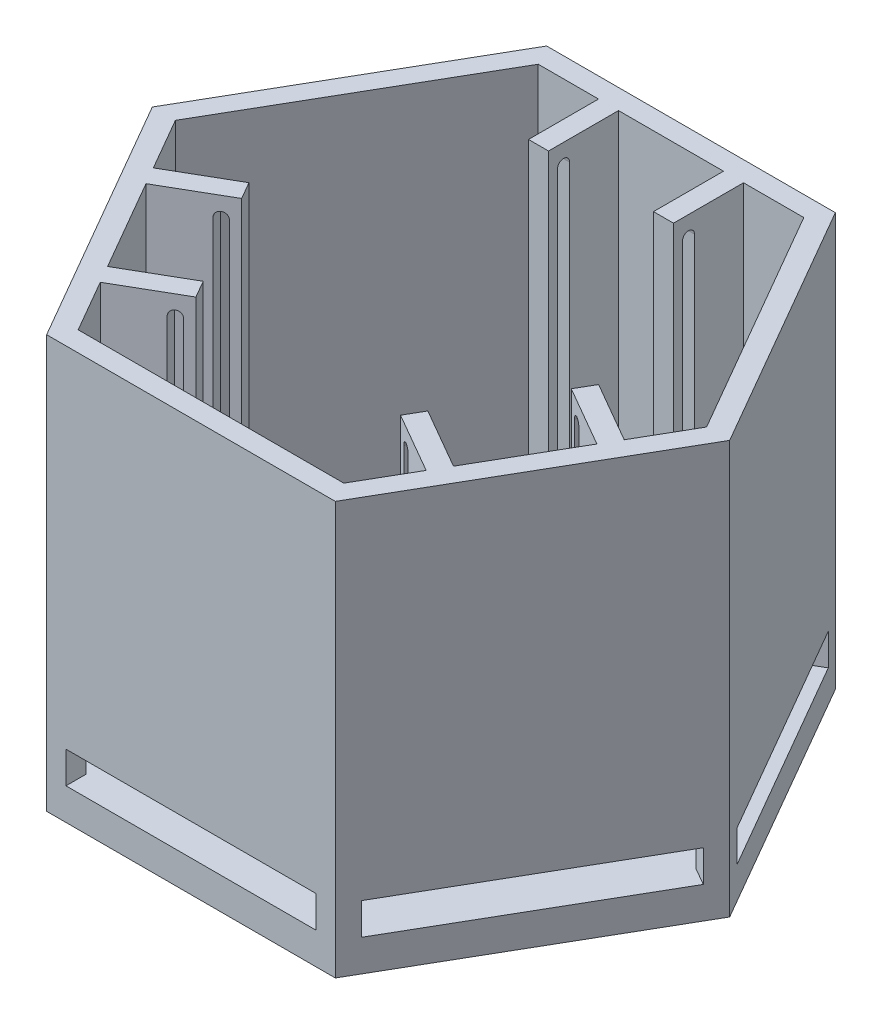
ISO-10303-21;
HEADER;
FILE_DESCRIPTION(('STEP AP214'),'2;1');
FILE_NAME('part.step','',(''),(''),'','','');
FILE_SCHEMA(('AUTOMOTIVE_DESIGN { 1 0 10303 214 1 1 1 1 }'));
ENDSEC;
DATA;
#1=APPLICATION_CONTEXT('core data for automotive mechanical design processes');
#2=APPLICATION_PROTOCOL_DEFINITION('international standard','automotive_design',2000,#1);
#3=PRODUCT_CONTEXT('',#1,'mechanical');
#4=PRODUCT('Part','Part','',(#3));
#5=PRODUCT_RELATED_PRODUCT_CATEGORY('part','',(#4));
#6=PRODUCT_DEFINITION_FORMATION('','',#4);
#7=PRODUCT_DEFINITION_CONTEXT('part definition',#1,'design');
#8=PRODUCT_DEFINITION('design','',#6,#7);
#9=PRODUCT_DEFINITION_SHAPE('','',#8);
#10=(LENGTH_UNIT() NAMED_UNIT(*) SI_UNIT(.MILLI.,.METRE.));
#11=(NAMED_UNIT(*) PLANE_ANGLE_UNIT() SI_UNIT($,.RADIAN.));
#12=(NAMED_UNIT(*) SI_UNIT($,.STERADIAN.) SOLID_ANGLE_UNIT());
#13=UNCERTAINTY_MEASURE_WITH_UNIT(LENGTH_MEASURE(1.E-05),#10,'distance_accuracy_value','');
#14=(GEOMETRIC_REPRESENTATION_CONTEXT(3) GLOBAL_UNCERTAINTY_ASSIGNED_CONTEXT((#13)) GLOBAL_UNIT_ASSIGNED_CONTEXT((#10,
#11,#12)) REPRESENTATION_CONTEXT('',''));
#15=CARTESIAN_POINT('',(0.,0.,0.));
#16=DIRECTION('',(0.,0.,1.));
#17=DIRECTION('',(1.,0.,0.));
#18=AXIS2_PLACEMENT_3D('',#15,#16,#17);
#19=CARTESIAN_POINT('',(-5.25000000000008,11.275,-16.));
#20=DIRECTION('',(1.,0.,0.));
#21=DIRECTION('',(0.,0.,-1.));
#22=AXIS2_PLACEMENT_3D('',#19,#20,#21);
#23=PLANE('',#22);
#24=DIRECTION('',(0.,0.,-1.));
#25=VECTOR('',#24,1.);
#26=CARTESIAN_POINT('',(-5.25000000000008,41.275,-16.));
#27=LINE('',#26,#25);
#28=CARTESIAN_POINT('',(-5.25000000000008,41.275,-16.));
#29=VERTEX_POINT('',#28);
#30=CARTESIAN_POINT('',(-5.25000000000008,41.275,-23.));
#31=VERTEX_POINT('',#30);
#32=EDGE_CURVE('E748',#29,#31,#27,.T.);
#33=ORIENTED_EDGE('',*,*,#32,.F.);
#34=DIRECTION('',(0.,1.,0.));
#35=VECTOR('',#34,1.);
#36=CARTESIAN_POINT('',(-5.25000000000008,11.275,-16.));
#37=LINE('',#36,#35);
#38=CARTESIAN_POINT('',(-5.25000000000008,11.275,-16.));
#39=VERTEX_POINT('',#38);
#40=EDGE_CURVE('E769',#39,#29,#37,.T.);
#41=ORIENTED_EDGE('',*,*,#40,.F.);
#42=DIRECTION('',(0.,0.,-1.));
#43=VECTOR('',#42,1.);
#44=CARTESIAN_POINT('',(-5.25000000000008,11.275,-16.));
#45=LINE('',#44,#43);
#46=CARTESIAN_POINT('',(-5.25000000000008,11.275,-23.));
#47=VERTEX_POINT('',#46);
#48=EDGE_CURVE('E754',#39,#47,#45,.T.);
#49=ORIENTED_EDGE('',*,*,#48,.T.);
#50=DIRECTION('',(0.,1.,0.));
#51=VECTOR('',#50,1.);
#52=CARTESIAN_POINT('',(-5.25000000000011,11.275,-23.));
#53=LINE('',#52,#51);
#54=EDGE_CURVE('E765',#47,#31,#53,.T.);
#55=ORIENTED_EDGE('',*,*,#54,.T.);
#56=EDGE_LOOP('',(#33,#41,#49,#55));
#57=FACE_BOUND('',#56,.T.);
#58=CARTESIAN_POINT('',(-5.25000000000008,13.275,-17.5));
#59=DIRECTION('',(1.,0.,0.));
#60=DIRECTION('',(0.,0.,-1.));
#61=AXIS2_PLACEMENT_3D('',#58,#59,#60);
#62=CIRCLE('',#61,0.600000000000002);
#63=CARTESIAN_POINT('',(-5.25000000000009,13.275,-16.9));
#64=VERTEX_POINT('',#63);
#65=CARTESIAN_POINT('',(-5.25000000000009,13.275,-18.1));
#66=VERTEX_POINT('',#65);
#67=EDGE_CURVE('E648',#64,#66,#62,.T.);
#68=ORIENTED_EDGE('',*,*,#67,.F.);
#69=DIRECTION('',(0.,1.,0.));
#70=VECTOR('',#69,1.);
#71=CARTESIAN_POINT('',(-5.25000000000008,11.275,-16.9));
#72=LINE('',#71,#70);
#73=CARTESIAN_POINT('',(-5.25000000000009,39.275,-16.9));
#74=VERTEX_POINT('',#73);
#75=EDGE_CURVE('E562',#64,#74,#72,.T.);
#76=ORIENTED_EDGE('',*,*,#75,.T.);
#77=CARTESIAN_POINT('',(-5.25000000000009,39.275,-17.5));
#78=DIRECTION('',(1.,0.,0.));
#79=DIRECTION('',(0.,0.,-1.));
#80=AXIS2_PLACEMENT_3D('',#77,#78,#79);
#81=CIRCLE('',#80,0.6);
#82=CARTESIAN_POINT('',(-5.25000000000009,39.275,-18.1));
#83=VERTEX_POINT('',#82);
#84=EDGE_CURVE('E639',#83,#74,#81,.T.);
#85=ORIENTED_EDGE('',*,*,#84,.F.);
#86=DIRECTION('',(0.,1.,0.));
#87=VECTOR('',#86,1.);
#88=CARTESIAN_POINT('',(-5.25000000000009,11.275,-18.1));
#89=LINE('',#88,#87);
#90=EDGE_CURVE('E644',#66,#83,#89,.T.);
#91=ORIENTED_EDGE('',*,*,#90,.F.);
#92=EDGE_LOOP('',(#68,#76,#85,#91));
#93=FACE_BOUND('',#92,.T.);
#94=ADVANCED_FACE('F38',(#57,#93),#23,.T.);
#95=CARTESIAN_POINT('',(-7.25000000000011,11.275,-23.));
#96=DIRECTION('',(-1.,0.,0.));
#97=DIRECTION('',(0.,0.,1.));
#98=AXIS2_PLACEMENT_3D('',#95,#96,#97);
#99=PLANE('',#98);
#100=DIRECTION('',(0.,0.,1.));
#101=VECTOR('',#100,1.);
#102=CARTESIAN_POINT('',(-7.25000000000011,41.275,-23.));
#103=LINE('',#102,#101);
#104=CARTESIAN_POINT('',(-7.25000000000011,41.275,-23.));
#105=VERTEX_POINT('',#104);
#106=CARTESIAN_POINT('',(-7.25000000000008,41.275,-16.));
#107=VERTEX_POINT('',#106);
#108=EDGE_CURVE('E738',#105,#107,#103,.T.);
#109=ORIENTED_EDGE('',*,*,#108,.F.);
#110=DIRECTION('',(0.,1.,0.));
#111=VECTOR('',#110,1.);
#112=CARTESIAN_POINT('',(-7.25000000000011,11.275,-23.));
#113=LINE('',#112,#111);
#114=CARTESIAN_POINT('',(-7.25000000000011,11.275,-23.));
#115=VERTEX_POINT('',#114);
#116=EDGE_CURVE('E757',#115,#105,#113,.T.);
#117=ORIENTED_EDGE('',*,*,#116,.F.);
#118=DIRECTION('',(0.,0.,1.));
#119=VECTOR('',#118,1.);
#120=CARTESIAN_POINT('',(-7.25000000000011,11.275,-23.));
#121=LINE('',#120,#119);
#122=CARTESIAN_POINT('',(-7.25000000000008,11.275,-16.));
#123=VERTEX_POINT('',#122);
#124=EDGE_CURVE('E747',#115,#123,#121,.T.);
#125=ORIENTED_EDGE('',*,*,#124,.T.);
#126=DIRECTION('',(0.,1.,0.));
#127=VECTOR('',#126,1.);
#128=CARTESIAN_POINT('',(-7.25000000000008,11.275,-16.));
#129=LINE('',#128,#127);
#130=EDGE_CURVE('E771',#123,#107,#129,.T.);
#131=ORIENTED_EDGE('',*,*,#130,.T.);
#132=EDGE_LOOP('',(#109,#117,#125,#131));
#133=FACE_BOUND('',#132,.T.);
#134=CARTESIAN_POINT('',(-7.25000000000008,39.275,-17.5));
#135=DIRECTION('',(-1.,0.,0.));
#136=DIRECTION('',(0.,0.,1.));
#137=AXIS2_PLACEMENT_3D('',#134,#135,#136);
#138=CIRCLE('',#137,0.6);
#139=CARTESIAN_POINT('',(-7.25000000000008,39.275,-16.9));
#140=VERTEX_POINT('',#139);
#141=CARTESIAN_POINT('',(-7.25000000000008,39.275,-18.1));
#142=VERTEX_POINT('',#141);
#143=EDGE_CURVE('E580',#140,#142,#138,.T.);
#144=ORIENTED_EDGE('',*,*,#143,.F.);
#145=DIRECTION('',(0.,-1.,0.));
#146=VECTOR('',#145,1.);
#147=CARTESIAN_POINT('',(-7.25000000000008,39.275,-16.9));
#148=LINE('',#147,#146);
#149=CARTESIAN_POINT('',(-7.25000000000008,13.275,-16.9));
#150=VERTEX_POINT('',#149);
#151=EDGE_CURVE('E61',#140,#150,#148,.T.);
#152=ORIENTED_EDGE('',*,*,#151,.T.);
#153=CARTESIAN_POINT('',(-7.25000000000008,13.275,-17.5));
#154=DIRECTION('',(-1.,0.,0.));
#155=DIRECTION('',(0.,0.,1.));
#156=AXIS2_PLACEMENT_3D('',#153,#154,#155);
#157=CIRCLE('',#156,0.600000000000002);
#158=CARTESIAN_POINT('',(-7.25000000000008,13.275,-18.1));
#159=VERTEX_POINT('',#158);
#160=EDGE_CURVE('E569',#159,#150,#157,.T.);
#161=ORIENTED_EDGE('',*,*,#160,.F.);
#162=DIRECTION('',(0.,-1.,0.));
#163=VECTOR('',#162,1.);
#164=CARTESIAN_POINT('',(-7.25000000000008,39.275,-18.1));
#165=LINE('',#164,#163);
#166=EDGE_CURVE('E576',#142,#159,#165,.T.);
#167=ORIENTED_EDGE('',*,*,#166,.F.);
#168=EDGE_LOOP('',(#144,#152,#161,#167));
#169=FACE_BOUND('',#168,.T.);
#170=ADVANCED_FACE('F579',(#133,#169),#99,.T.);
#171=CARTESIAN_POINT('',(7.24999999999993,11.275,-16.));
#172=DIRECTION('',(1.,0.,0.));
#173=DIRECTION('',(0.,0.,-1.));
#174=AXIS2_PLACEMENT_3D('',#171,#172,#173);
#175=PLANE('',#174);
#176=DIRECTION('',(0.,0.,-1.));
#177=VECTOR('',#176,1.);
#178=CARTESIAN_POINT('',(7.24999999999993,41.275,-16.));
#179=LINE('',#178,#177);
#180=CARTESIAN_POINT('',(7.24999999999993,41.275,-16.));
#181=VERTEX_POINT('',#180);
#182=CARTESIAN_POINT('',(7.24999999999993,41.275,-23.));
#183=VERTEX_POINT('',#182);
#184=EDGE_CURVE('E718',#181,#183,#179,.T.);
#185=ORIENTED_EDGE('',*,*,#184,.F.);
#186=DIRECTION('',(0.,1.,0.));
#187=VECTOR('',#186,1.);
#188=CARTESIAN_POINT('',(7.24999999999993,11.275,-16.));
#189=LINE('',#188,#187);
#190=CARTESIAN_POINT('',(7.24999999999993,11.275,-16.));
#191=VERTEX_POINT('',#190);
#192=EDGE_CURVE('E739',#191,#181,#189,.T.);
#193=ORIENTED_EDGE('',*,*,#192,.F.);
#194=DIRECTION('',(0.,0.,-1.));
#195=VECTOR('',#194,1.);
#196=CARTESIAN_POINT('',(7.24999999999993,11.275,-16.));
#197=LINE('',#196,#195);
#198=CARTESIAN_POINT('',(7.24999999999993,11.275,-23.));
#199=VERTEX_POINT('',#198);
#200=EDGE_CURVE('E724',#191,#199,#197,.T.);
#201=ORIENTED_EDGE('',*,*,#200,.T.);
#202=DIRECTION('',(0.,1.,0.));
#203=VECTOR('',#202,1.);
#204=CARTESIAN_POINT('',(7.24999999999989,11.275,-23.));
#205=LINE('',#204,#203);
#206=EDGE_CURVE('E735',#199,#183,#205,.T.);
#207=ORIENTED_EDGE('',*,*,#206,.T.);
#208=EDGE_LOOP('',(#185,#193,#201,#207));
#209=FACE_BOUND('',#208,.T.);
#210=CARTESIAN_POINT('',(7.24999999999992,13.275,-17.5));
#211=DIRECTION('',(1.,0.,0.));
#212=DIRECTION('',(0.,0.,-1.));
#213=AXIS2_PLACEMENT_3D('',#210,#211,#212);
#214=CIRCLE('',#213,0.600000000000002);
#215=CARTESIAN_POINT('',(7.24999999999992,13.275,-16.9));
#216=VERTEX_POINT('',#215);
#217=CARTESIAN_POINT('',(7.24999999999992,13.275,-18.1));
#218=VERTEX_POINT('',#217);
#219=EDGE_CURVE('E646',#216,#218,#214,.T.);
#220=ORIENTED_EDGE('',*,*,#219,.F.);
#221=DIRECTION('',(0.,1.,0.));
#222=VECTOR('',#221,1.);
#223=CARTESIAN_POINT('',(7.24999999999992,11.275,-16.9));
#224=LINE('',#223,#222);
#225=CARTESIAN_POINT('',(7.24999999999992,39.275,-16.9));
#226=VERTEX_POINT('',#225);
#227=EDGE_CURVE('E650',#216,#226,#224,.T.);
#228=ORIENTED_EDGE('',*,*,#227,.T.);
#229=CARTESIAN_POINT('',(7.24999999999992,39.275,-17.5));
#230=DIRECTION('',(1.,0.,0.));
#231=DIRECTION('',(0.,0.,-1.));
#232=AXIS2_PLACEMENT_3D('',#229,#230,#231);
#233=CIRCLE('',#232,0.6);
#234=CARTESIAN_POINT('',(7.24999999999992,39.275,-18.1));
#235=VERTEX_POINT('',#234);
#236=EDGE_CURVE('E637',#235,#226,#233,.T.);
#237=ORIENTED_EDGE('',*,*,#236,.F.);
#238=DIRECTION('',(0.,1.,0.));
#239=VECTOR('',#238,1.);
#240=CARTESIAN_POINT('',(7.24999999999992,11.275,-18.1));
#241=LINE('',#240,#239);
#242=EDGE_CURVE('E641',#218,#235,#241,.T.);
#243=ORIENTED_EDGE('',*,*,#242,.F.);
#244=EDGE_LOOP('',(#220,#228,#237,#243));
#245=FACE_BOUND('',#244,.T.);
#246=ADVANCED_FACE('F1182',(#209,#245),#175,.T.);
#247=CARTESIAN_POINT('',(5.24999999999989,11.275,-23.));
#248=DIRECTION('',(-1.,0.,0.));
#249=DIRECTION('',(0.,0.,1.));
#250=AXIS2_PLACEMENT_3D('',#247,#248,#249);
#251=PLANE('',#250);
#252=DIRECTION('',(0.,0.,1.));
#253=VECTOR('',#252,1.);
#254=CARTESIAN_POINT('',(5.24999999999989,41.275,-23.));
#255=LINE('',#254,#253);
#256=CARTESIAN_POINT('',(5.24999999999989,41.275,-23.));
#257=VERTEX_POINT('',#256);
#258=CARTESIAN_POINT('',(5.24999999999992,41.275,-16.));
#259=VERTEX_POINT('',#258);
#260=EDGE_CURVE('E708',#257,#259,#255,.T.);
#261=ORIENTED_EDGE('',*,*,#260,.F.);
#262=DIRECTION('',(0.,1.,0.));
#263=VECTOR('',#262,1.);
#264=CARTESIAN_POINT('',(5.24999999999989,11.275,-23.));
#265=LINE('',#264,#263);
#266=CARTESIAN_POINT('',(5.24999999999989,11.275,-23.));
#267=VERTEX_POINT('',#266);
#268=EDGE_CURVE('E727',#267,#257,#265,.T.);
#269=ORIENTED_EDGE('',*,*,#268,.F.);
#270=DIRECTION('',(0.,0.,1.));
#271=VECTOR('',#270,1.);
#272=CARTESIAN_POINT('',(5.24999999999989,11.275,-23.));
#273=LINE('',#272,#271);
#274=CARTESIAN_POINT('',(5.24999999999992,11.275,-16.));
#275=VERTEX_POINT('',#274);
#276=EDGE_CURVE('E717',#267,#275,#273,.T.);
#277=ORIENTED_EDGE('',*,*,#276,.T.);
#278=DIRECTION('',(0.,1.,0.));
#279=VECTOR('',#278,1.);
#280=CARTESIAN_POINT('',(5.24999999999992,11.275,-16.));
#281=LINE('',#280,#279);
#282=EDGE_CURVE('E741',#275,#259,#281,.T.);
#283=ORIENTED_EDGE('',*,*,#282,.T.);
#284=EDGE_LOOP('',(#261,#269,#277,#283));
#285=FACE_BOUND('',#284,.T.);
#286=CARTESIAN_POINT('',(5.24999999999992,39.275,-17.5));
#287=DIRECTION('',(-1.,0.,0.));
#288=DIRECTION('',(0.,0.,1.));
#289=AXIS2_PLACEMENT_3D('',#286,#287,#288);
#290=CIRCLE('',#289,0.6);
#291=CARTESIAN_POINT('',(5.24999999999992,39.275,-16.9));
#292=VERTEX_POINT('',#291);
#293=CARTESIAN_POINT('',(5.24999999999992,39.275,-18.1));
#294=VERTEX_POINT('',#293);
#295=EDGE_CURVE('E1155',#292,#294,#290,.T.);
#296=ORIENTED_EDGE('',*,*,#295,.F.);
#297=DIRECTION('',(0.,-1.,0.));
#298=VECTOR('',#297,1.);
#299=CARTESIAN_POINT('',(5.24999999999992,11.275,-16.9));
#300=LINE('',#299,#298);
#301=CARTESIAN_POINT('',(5.24999999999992,13.275,-16.9));
#302=VERTEX_POINT('',#301);
#303=EDGE_CURVE('E11',#292,#302,#300,.T.);
#304=ORIENTED_EDGE('',*,*,#303,.T.);
#305=CARTESIAN_POINT('',(5.24999999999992,13.275,-17.5));
#306=DIRECTION('',(-1.,0.,0.));
#307=DIRECTION('',(0.,0.,1.));
#308=AXIS2_PLACEMENT_3D('',#305,#306,#307);
#309=CIRCLE('',#308,0.600000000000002);
#310=CARTESIAN_POINT('',(5.24999999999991,13.275,-18.1));
#311=VERTEX_POINT('',#310);
#312=EDGE_CURVE('E46',#311,#302,#309,.T.);
#313=ORIENTED_EDGE('',*,*,#312,.F.);
#314=DIRECTION('',(0.,-1.,0.));
#315=VECTOR('',#314,1.);
#316=CARTESIAN_POINT('',(5.24999999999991,11.275,-18.1));
#317=LINE('',#316,#315);
#318=EDGE_CURVE('E1157',#294,#311,#317,.T.);
#319=ORIENTED_EDGE('',*,*,#318,.F.);
#320=EDGE_LOOP('',(#296,#304,#313,#319));
#321=FACE_BOUND('',#320,.T.);
#322=ADVANCED_FACE('F1173',(#285,#321),#251,.T.);
#323=CARTESIAN_POINT('',(-11.2314064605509,11.275,12.5466333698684));
#324=DIRECTION('',(-0.500000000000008,0.,-0.866025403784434));
#325=DIRECTION('',(-0.866025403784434,0.,0.500000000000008));
#326=AXIS2_PLACEMENT_3D('',#323,#324,#325);
#327=PLANE('',#326);
#328=DIRECTION('',(-0.866025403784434,0.,0.500000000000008));
#329=VECTOR('',#328,1.);
#330=CARTESIAN_POINT('',(-11.2314064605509,41.275,12.5466333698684));
#331=LINE('',#330,#329);
#332=CARTESIAN_POINT('',(-11.2314064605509,41.275,12.5466333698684));
#333=VERTEX_POINT('',#332);
#334=CARTESIAN_POINT('',(-17.2935842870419,41.275,16.0466333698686));
#335=VERTEX_POINT('',#334);
#336=EDGE_CURVE('E688',#333,#335,#331,.T.);
#337=ORIENTED_EDGE('',*,*,#336,.F.);
#338=DIRECTION('',(0.,1.,0.));
#339=VECTOR('',#338,1.);
#340=CARTESIAN_POINT('',(-11.2314064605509,11.275,12.5466333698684));
#341=LINE('',#340,#339);
#342=CARTESIAN_POINT('',(-11.2314064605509,11.275,12.5466333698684));
#343=VERTEX_POINT('',#342);
#344=EDGE_CURVE('E709',#343,#333,#341,.T.);
#345=ORIENTED_EDGE('',*,*,#344,.F.);
#346=DIRECTION('',(-0.866025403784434,0.,0.500000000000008));
#347=VECTOR('',#346,1.);
#348=CARTESIAN_POINT('',(-11.2314064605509,11.275,12.5466333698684));
#349=LINE('',#348,#347);
#350=CARTESIAN_POINT('',(-17.2935842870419,11.275,16.0466333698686));
#351=VERTEX_POINT('',#350);
#352=EDGE_CURVE('E694',#343,#351,#349,.T.);
#353=ORIENTED_EDGE('',*,*,#352,.T.);
#354=DIRECTION('',(0.,1.,0.));
#355=VECTOR('',#354,1.);
#356=CARTESIAN_POINT('',(-17.2935842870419,11.275,16.0466333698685));
#357=LINE('',#356,#355);
#358=EDGE_CURVE('E705',#351,#335,#357,.T.);
#359=ORIENTED_EDGE('',*,*,#358,.T.);
#360=EDGE_LOOP('',(#337,#345,#353,#359));
#361=FACE_BOUND('',#360,.T.);
#362=CARTESIAN_POINT('',(-12.5304445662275,13.275,13.2966333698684));
#363=DIRECTION('',(-0.500000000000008,0.,-0.866025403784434));
#364=DIRECTION('',(-0.866025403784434,0.,0.500000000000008));
#365=AXIS2_PLACEMENT_3D('',#362,#363,#364);
#366=CIRCLE('',#365,0.600000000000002);
#367=CARTESIAN_POINT('',(-12.0108293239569,13.275,12.9966333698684));
#368=VERTEX_POINT('',#367);
#369=CARTESIAN_POINT('',(-13.0500598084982,13.275,13.5966333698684));
#370=VERTEX_POINT('',#369);
#371=EDGE_CURVE('E629',#368,#370,#366,.T.);
#372=ORIENTED_EDGE('',*,*,#371,.F.);
#373=DIRECTION('',(0.,1.,0.));
#374=VECTOR('',#373,1.);
#375=CARTESIAN_POINT('',(-12.0108293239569,11.275,12.9966333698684));
#376=LINE('',#375,#374);
#377=CARTESIAN_POINT('',(-12.0108293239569,39.275,12.9966333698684));
#378=VERTEX_POINT('',#377);
#379=EDGE_CURVE('E634',#368,#378,#376,.T.);
#380=ORIENTED_EDGE('',*,*,#379,.T.);
#381=CARTESIAN_POINT('',(-12.5304445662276,39.275,13.2966333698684));
#382=DIRECTION('',(-0.500000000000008,0.,-0.866025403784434));
#383=DIRECTION('',(-0.866025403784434,0.,0.500000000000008));
#384=AXIS2_PLACEMENT_3D('',#381,#382,#383);
#385=CIRCLE('',#384,0.6);
#386=CARTESIAN_POINT('',(-13.0500598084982,39.275,13.5966333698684));
#387=VERTEX_POINT('',#386);
#388=EDGE_CURVE('E619',#387,#378,#385,.T.);
#389=ORIENTED_EDGE('',*,*,#388,.F.);
#390=DIRECTION('',(0.,1.,0.));
#391=VECTOR('',#390,1.);
#392=CARTESIAN_POINT('',(-13.0500598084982,11.275,13.5966333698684));
#393=LINE('',#392,#391);
#394=EDGE_CURVE('E624',#370,#387,#393,.T.);
#395=ORIENTED_EDGE('',*,*,#394,.F.);
#396=EDGE_LOOP('',(#372,#380,#389,#395));
#397=FACE_BOUND('',#396,.T.);
#398=ADVANCED_FACE('F1190',(#361,#397),#327,.T.);
#399=CARTESIAN_POINT('',(-16.2935842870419,11.275,17.7786841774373));
#400=DIRECTION('',(0.500000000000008,0.,0.866025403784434));
#401=DIRECTION('',(0.866025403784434,0.,-0.500000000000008));
#402=AXIS2_PLACEMENT_3D('',#399,#400,#401);
#403=PLANE('',#402);
#404=DIRECTION('',(0.866025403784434,0.,-0.500000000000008));
#405=VECTOR('',#404,1.);
#406=CARTESIAN_POINT('',(-16.2935842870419,41.275,17.7786841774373));
#407=LINE('',#406,#405);
#408=CARTESIAN_POINT('',(-16.2935842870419,41.275,17.7786841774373));
#409=VERTEX_POINT('',#408);
#410=CARTESIAN_POINT('',(-10.2314064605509,41.275,14.2786841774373));
#411=VERTEX_POINT('',#410);
#412=EDGE_CURVE('E678',#409,#411,#407,.T.);
#413=ORIENTED_EDGE('',*,*,#412,.F.);
#414=DIRECTION('',(0.,1.,0.));
#415=VECTOR('',#414,1.);
#416=CARTESIAN_POINT('',(-16.2935842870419,11.275,17.7786841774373));
#417=LINE('',#416,#415);
#418=CARTESIAN_POINT('',(-16.293584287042,11.275,17.7786841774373));
#419=VERTEX_POINT('',#418);
#420=EDGE_CURVE('E697',#419,#409,#417,.T.);
#421=ORIENTED_EDGE('',*,*,#420,.F.);
#422=DIRECTION('',(0.866025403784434,0.,-0.500000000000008));
#423=VECTOR('',#422,1.);
#424=CARTESIAN_POINT('',(-16.2935842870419,11.275,17.7786841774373));
#425=LINE('',#424,#423);
#426=CARTESIAN_POINT('',(-10.2314064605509,11.275,14.2786841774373));
#427=VERTEX_POINT('',#426);
#428=EDGE_CURVE('E687',#419,#427,#425,.T.);
#429=ORIENTED_EDGE('',*,*,#428,.T.);
#430=DIRECTION('',(0.,1.,0.));
#431=VECTOR('',#430,1.);
#432=CARTESIAN_POINT('',(-10.2314064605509,11.275,14.2786841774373));
#433=LINE('',#432,#431);
#434=EDGE_CURVE('E711',#427,#411,#433,.T.);
#435=ORIENTED_EDGE('',*,*,#434,.T.);
#436=EDGE_LOOP('',(#413,#421,#429,#435));
#437=FACE_BOUND('',#436,.T.);
#438=CARTESIAN_POINT('',(-11.5304445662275,39.275,15.0286841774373));
#439=DIRECTION('',(0.500000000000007,0.,0.866025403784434));
#440=DIRECTION('',(0.866025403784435,0.,-0.500000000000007));
#441=AXIS2_PLACEMENT_3D('',#438,#439,#440);
#442=CIRCLE('',#441,0.6);
#443=CARTESIAN_POINT('',(-11.0108293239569,39.275,14.7286841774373));
#444=VERTEX_POINT('',#443);
#445=CARTESIAN_POINT('',(-12.0500598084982,39.275,15.3286841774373));
#446=VERTEX_POINT('',#445);
#447=EDGE_CURVE('E604',#444,#446,#442,.T.);
#448=ORIENTED_EDGE('',*,*,#447,.F.);
#449=DIRECTION('',(0.,-1.,0.));
#450=VECTOR('',#449,1.);
#451=CARTESIAN_POINT('',(-11.0108293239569,39.275,14.7286841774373));
#452=LINE('',#451,#450);
#453=CARTESIAN_POINT('',(-11.0108293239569,13.275,14.7286841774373));
#454=VERTEX_POINT('',#453);
#455=EDGE_CURVE('E595',#444,#454,#452,.T.);
#456=ORIENTED_EDGE('',*,*,#455,.T.);
#457=CARTESIAN_POINT('',(-11.5304445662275,13.275,15.0286841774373));
#458=DIRECTION('',(0.500000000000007,0.,0.866025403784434));
#459=DIRECTION('',(0.866025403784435,0.,-0.500000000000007));
#460=AXIS2_PLACEMENT_3D('',#457,#458,#459);
#461=CIRCLE('',#460,0.600000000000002);
#462=CARTESIAN_POINT('',(-12.0500598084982,13.275,15.3286841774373));
#463=VERTEX_POINT('',#462);
#464=EDGE_CURVE('E598',#463,#454,#461,.T.);
#465=ORIENTED_EDGE('',*,*,#464,.F.);
#466=DIRECTION('',(0.,-1.,0.));
#467=VECTOR('',#466,1.);
#468=CARTESIAN_POINT('',(-12.0500598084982,39.275,15.3286841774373));
#469=LINE('',#468,#467);
#470=EDGE_CURVE('E601',#446,#463,#469,.T.);
#471=ORIENTED_EDGE('',*,*,#470,.F.);
#472=EDGE_LOOP('',(#448,#456,#465,#471));
#473=FACE_BOUND('',#472,.T.);
#474=ADVANCED_FACE('F1772',(#437,#473),#403,.T.);
#475=CARTESIAN_POINT('',(-17.481406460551,11.275,1.72131582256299));
#476=DIRECTION('',(-0.500000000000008,0.,-0.866025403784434));
#477=DIRECTION('',(-0.866025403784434,0.,0.500000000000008));
#478=AXIS2_PLACEMENT_3D('',#475,#476,#477);
#479=PLANE('',#478);
#480=DIRECTION('',(-0.866025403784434,0.,0.500000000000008));
#481=VECTOR('',#480,1.);
#482=CARTESIAN_POINT('',(-17.481406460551,41.275,1.72131582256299));
#483=LINE('',#482,#481);
#484=CARTESIAN_POINT('',(-17.481406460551,41.275,1.72131582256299));
#485=VERTEX_POINT('',#484);
#486=CARTESIAN_POINT('',(-23.543584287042,41.275,5.22131582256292));
#487=VERTEX_POINT('',#486);
#488=EDGE_CURVE('E658',#485,#487,#483,.T.);
#489=ORIENTED_EDGE('',*,*,#488,.F.);
#490=DIRECTION('',(0.,1.,0.));
#491=VECTOR('',#490,1.);
#492=CARTESIAN_POINT('',(-17.481406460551,11.275,1.72131582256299));
#493=LINE('',#492,#491);
#494=CARTESIAN_POINT('',(-17.481406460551,11.275,1.72131582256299));
#495=VERTEX_POINT('',#494);
#496=EDGE_CURVE('E679',#495,#485,#493,.T.);
#497=ORIENTED_EDGE('',*,*,#496,.F.);
#498=DIRECTION('',(-0.866025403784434,0.,0.500000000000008));
#499=VECTOR('',#498,1.);
#500=CARTESIAN_POINT('',(-17.481406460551,11.275,1.72131582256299));
#501=LINE('',#500,#499);
#502=CARTESIAN_POINT('',(-23.543584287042,11.275,5.22131582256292));
#503=VERTEX_POINT('',#502);
#504=EDGE_CURVE('E664',#495,#503,#501,.T.);
#505=ORIENTED_EDGE('',*,*,#504,.T.);
#506=DIRECTION('',(0.,1.,0.));
#507=VECTOR('',#506,1.);
#508=CARTESIAN_POINT('',(-23.543584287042,11.275,5.22131582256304));
#509=LINE('',#508,#507);
#510=EDGE_CURVE('E675',#503,#487,#509,.T.);
#511=ORIENTED_EDGE('',*,*,#510,.T.);
#512=EDGE_LOOP('',(#489,#497,#505,#511));
#513=FACE_BOUND('',#512,.T.);
#514=CARTESIAN_POINT('',(-18.7804445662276,13.275,2.47131582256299));
#515=DIRECTION('',(-0.500000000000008,0.,-0.866025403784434));
#516=DIRECTION('',(-0.866025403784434,0.,0.500000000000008));
#517=AXIS2_PLACEMENT_3D('',#514,#515,#516);
#518=CIRCLE('',#517,0.600000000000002);
#519=CARTESIAN_POINT('',(-18.260829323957,13.275,2.17131582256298));
#520=VERTEX_POINT('',#519);
#521=CARTESIAN_POINT('',(-19.3000598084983,13.275,2.771315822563));
#522=VERTEX_POINT('',#521);
#523=EDGE_CURVE('E627',#520,#522,#518,.T.);
#524=ORIENTED_EDGE('',*,*,#523,.F.);
#525=DIRECTION('',(0.,1.,0.));
#526=VECTOR('',#525,1.);
#527=CARTESIAN_POINT('',(-18.260829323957,11.275,2.17131582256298));
#528=LINE('',#527,#526);
#529=CARTESIAN_POINT('',(-18.260829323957,39.275,2.17131582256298));
#530=VERTEX_POINT('',#529);
#531=EDGE_CURVE('E631',#520,#530,#528,.T.);
#532=ORIENTED_EDGE('',*,*,#531,.T.);
#533=CARTESIAN_POINT('',(-18.7804445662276,39.275,2.47131582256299));
#534=DIRECTION('',(-0.500000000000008,0.,-0.866025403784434));
#535=DIRECTION('',(-0.866025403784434,0.,0.500000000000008));
#536=AXIS2_PLACEMENT_3D('',#533,#534,#535);
#537=CIRCLE('',#536,0.6);
#538=CARTESIAN_POINT('',(-19.3000598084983,39.275,2.771315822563));
#539=VERTEX_POINT('',#538);
#540=EDGE_CURVE('E617',#539,#530,#537,.T.);
#541=ORIENTED_EDGE('',*,*,#540,.F.);
#542=DIRECTION('',(0.,1.,0.));
#543=VECTOR('',#542,1.);
#544=CARTESIAN_POINT('',(-19.3000598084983,11.275,2.771315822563));
#545=LINE('',#544,#543);
#546=EDGE_CURVE('E621',#522,#539,#545,.T.);
#547=ORIENTED_EDGE('',*,*,#546,.F.);
#548=EDGE_LOOP('',(#524,#532,#541,#547));
#549=FACE_BOUND('',#548,.T.);
#550=ADVANCED_FACE('F1432',(#513,#549),#479,.T.);
#551=CARTESIAN_POINT('',(-22.543584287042,11.275,6.95336663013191));
#552=DIRECTION('',(0.500000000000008,0.,0.866025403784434));
#553=DIRECTION('',(0.866025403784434,0.,-0.500000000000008));
#554=AXIS2_PLACEMENT_3D('',#551,#552,#553);
#555=PLANE('',#554);
#556=DIRECTION('',(0.866025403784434,0.,-0.500000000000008));
#557=VECTOR('',#556,1.);
#558=CARTESIAN_POINT('',(-22.543584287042,41.275,6.95336663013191));
#559=LINE('',#558,#557);
#560=CARTESIAN_POINT('',(-22.543584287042,41.275,6.95336663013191));
#561=VERTEX_POINT('',#560);
#562=CARTESIAN_POINT('',(-16.481406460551,41.275,3.45336663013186));
#563=VERTEX_POINT('',#562);
#564=EDGE_CURVE('E654',#561,#563,#559,.T.);
#565=ORIENTED_EDGE('',*,*,#564,.F.);
#566=DIRECTION('',(0.,1.,0.));
#567=VECTOR('',#566,1.);
#568=CARTESIAN_POINT('',(-22.543584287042,11.275,6.95336663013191));
#569=LINE('',#568,#567);
#570=CARTESIAN_POINT('',(-22.543584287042,11.275,6.95336663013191));
#571=VERTEX_POINT('',#570);
#572=EDGE_CURVE('E667',#571,#561,#569,.T.);
#573=ORIENTED_EDGE('',*,*,#572,.F.);
#574=DIRECTION('',(0.866025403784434,0.,-0.500000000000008));
#575=VECTOR('',#574,1.);
#576=CARTESIAN_POINT('',(-22.543584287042,11.275,6.95336663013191));
#577=LINE('',#576,#575);
#578=CARTESIAN_POINT('',(-16.481406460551,11.275,3.45336663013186));
#579=VERTEX_POINT('',#578);
#580=EDGE_CURVE('E657',#571,#579,#577,.T.);
#581=ORIENTED_EDGE('',*,*,#580,.T.);
#582=DIRECTION('',(0.,1.,0.));
#583=VECTOR('',#582,1.);
#584=CARTESIAN_POINT('',(-16.481406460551,11.275,3.45336663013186));
#585=LINE('',#584,#583);
#586=EDGE_CURVE('E681',#579,#563,#585,.T.);
#587=ORIENTED_EDGE('',*,*,#586,.T.);
#588=EDGE_LOOP('',(#565,#573,#581,#587));
#589=FACE_BOUND('',#588,.T.);
#590=CARTESIAN_POINT('',(-17.7804445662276,39.275,4.20336663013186));
#591=DIRECTION('',(0.500000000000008,0.,0.866025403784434));
#592=DIRECTION('',(0.866025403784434,0.,-0.500000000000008));
#593=AXIS2_PLACEMENT_3D('',#590,#591,#592);
#594=CIRCLE('',#593,0.6);
#595=CARTESIAN_POINT('',(-17.260829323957,39.275,3.90336663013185));
#596=VERTEX_POINT('',#595);
#597=CARTESIAN_POINT('',(-18.3000598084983,39.275,4.50336663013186));
#598=VERTEX_POINT('',#597);
#599=EDGE_CURVE('E1146',#596,#598,#594,.T.);
#600=ORIENTED_EDGE('',*,*,#599,.F.);
#601=DIRECTION('',(0.,-1.,0.));
#602=VECTOR('',#601,1.);
#603=CARTESIAN_POINT('',(-17.260829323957,11.275,3.90336663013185));
#604=LINE('',#603,#602);
#605=CARTESIAN_POINT('',(-17.260829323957,13.275,3.90336663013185));
#606=VERTEX_POINT('',#605);
#607=EDGE_CURVE('E1152',#596,#606,#604,.T.);
#608=ORIENTED_EDGE('',*,*,#607,.T.);
#609=CARTESIAN_POINT('',(-17.7804445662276,13.275,4.20336663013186));
#610=DIRECTION('',(0.500000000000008,0.,0.866025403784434));
#611=DIRECTION('',(0.866025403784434,0.,-0.500000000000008));
#612=AXIS2_PLACEMENT_3D('',#609,#610,#611);
#613=CIRCLE('',#612,0.600000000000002);
#614=CARTESIAN_POINT('',(-18.3000598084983,13.275,4.50336663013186));
#615=VERTEX_POINT('',#614);
#616=EDGE_CURVE('E1150',#615,#606,#613,.T.);
#617=ORIENTED_EDGE('',*,*,#616,.F.);
#618=DIRECTION('',(0.,-1.,0.));
#619=VECTOR('',#618,1.);
#620=CARTESIAN_POINT('',(-18.3000598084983,11.275,4.50336663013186));
#621=LINE('',#620,#619);
#622=EDGE_CURVE('E1148',#598,#615,#621,.T.);
#623=ORIENTED_EDGE('',*,*,#622,.F.);
#624=EDGE_LOOP('',(#600,#608,#617,#623));
#625=FACE_BOUND('',#624,.T.);
#626=ADVANCED_FACE('F1284',(#589,#625),#555,.T.);
#627=CARTESIAN_POINT('',(16.481406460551,11.275,3.4533666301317));
#628=DIRECTION('',(-0.5,0.,0.866025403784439));
#629=DIRECTION('',(0.866025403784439,0.,0.5));
#630=AXIS2_PLACEMENT_3D('',#627,#628,#629);
#631=PLANE('',#630);
#632=DIRECTION('',(0.866025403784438,0.,0.5));
#633=VECTOR('',#632,1.);
#634=CARTESIAN_POINT('',(16.481406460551,41.275,3.4533666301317));
#635=LINE('',#634,#633);
#636=CARTESIAN_POINT('',(16.481406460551,41.275,3.4533666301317));
#637=VERTEX_POINT('',#636);
#638=CARTESIAN_POINT('',(22.5435842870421,41.275,6.9533666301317));
#639=VERTEX_POINT('',#638);
#640=EDGE_CURVE('E949',#637,#639,#635,.T.);
#641=ORIENTED_EDGE('',*,*,#640,.F.);
#642=DIRECTION('',(0.,1.,0.));
#643=VECTOR('',#642,1.);
#644=CARTESIAN_POINT('',(16.481406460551,11.275,3.4533666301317));
#645=LINE('',#644,#643);
#646=CARTESIAN_POINT('',(16.481406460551,11.275,3.4533666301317));
#647=VERTEX_POINT('',#646);
#648=EDGE_CURVE('E970',#647,#637,#645,.T.);
#649=ORIENTED_EDGE('',*,*,#648,.F.);
#650=DIRECTION('',(0.866025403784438,0.,0.5));
#651=VECTOR('',#650,1.);
#652=CARTESIAN_POINT('',(16.481406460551,11.275,3.4533666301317));
#653=LINE('',#652,#651);
#654=CARTESIAN_POINT('',(22.5435842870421,11.275,6.9533666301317));
#655=VERTEX_POINT('',#654);
#656=EDGE_CURVE('E955',#647,#655,#653,.T.);
#657=ORIENTED_EDGE('',*,*,#656,.T.);
#658=DIRECTION('',(0.,1.,0.));
#659=VECTOR('',#658,1.);
#660=CARTESIAN_POINT('',(22.5435842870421,11.275,6.9533666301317));
#661=LINE('',#660,#659);
#662=EDGE_CURVE('E966',#655,#639,#661,.T.);
#663=ORIENTED_EDGE('',*,*,#662,.T.);
#664=EDGE_LOOP('',(#641,#649,#657,#663));
#665=FACE_BOUND('',#664,.T.);
#666=CARTESIAN_POINT('',(17.7804445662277,13.275,4.20336663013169));
#667=DIRECTION('',(-0.5,0.,0.866025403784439));
#668=DIRECTION('',(0.866025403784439,0.,0.5));
#669=AXIS2_PLACEMENT_3D('',#666,#667,#668);
#670=CIRCLE('',#669,0.600000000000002);
#671=CARTESIAN_POINT('',(17.260829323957,13.275,3.90336663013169));
#672=VERTEX_POINT('',#671);
#673=CARTESIAN_POINT('',(18.3000598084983,13.275,4.5033666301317));
#674=VERTEX_POINT('',#673);
#675=EDGE_CURVE('E907',#672,#674,#670,.T.);
#676=ORIENTED_EDGE('',*,*,#675,.F.);
#677=DIRECTION('',(0.,1.,0.));
#678=VECTOR('',#677,1.);
#679=CARTESIAN_POINT('',(17.260829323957,11.275,3.90336663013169));
#680=LINE('',#679,#678);
#681=CARTESIAN_POINT('',(17.260829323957,39.275,3.90336663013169));
#682=VERTEX_POINT('',#681);
#683=EDGE_CURVE('E912',#672,#682,#680,.T.);
#684=ORIENTED_EDGE('',*,*,#683,.T.);
#685=CARTESIAN_POINT('',(17.7804445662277,39.275,4.20336663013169));
#686=DIRECTION('',(-0.5,0.,0.866025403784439));
#687=DIRECTION('',(0.866025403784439,0.,0.5));
#688=AXIS2_PLACEMENT_3D('',#685,#686,#687);
#689=CIRCLE('',#688,0.6);
#690=CARTESIAN_POINT('',(18.3000598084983,39.275,4.50336663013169));
#691=VERTEX_POINT('',#690);
#692=EDGE_CURVE('E897',#691,#682,#689,.T.);
#693=ORIENTED_EDGE('',*,*,#692,.F.);
#694=DIRECTION('',(0.,1.,0.));
#695=VECTOR('',#694,1.);
#696=CARTESIAN_POINT('',(18.3000598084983,11.275,4.50336663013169));
#697=LINE('',#696,#695);
#698=EDGE_CURVE('E902',#674,#691,#697,.T.);
#699=ORIENTED_EDGE('',*,*,#698,.F.);
#700=EDGE_LOOP('',(#676,#684,#693,#699));
#701=FACE_BOUND('',#700,.T.);
#702=ADVANCED_FACE('F1281',(#665,#701),#631,.T.);
#703=CARTESIAN_POINT('',(23.5435842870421,11.275,5.22131582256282));
#704=DIRECTION('',(0.5,0.,-0.866025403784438));
#705=DIRECTION('',(-0.866025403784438,0.,-0.5));
#706=AXIS2_PLACEMENT_3D('',#703,#704,#705);
#707=PLANE('',#706);
#708=DIRECTION('',(-0.866025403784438,0.,-0.5));
#709=VECTOR('',#708,1.);
#710=CARTESIAN_POINT('',(23.5435842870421,41.275,5.22131582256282));
#711=LINE('',#710,#709);
#712=CARTESIAN_POINT('',(23.5435842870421,41.275,5.22131582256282));
#713=VERTEX_POINT('',#712);
#714=CARTESIAN_POINT('',(17.481406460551,41.275,1.72131582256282));
#715=VERTEX_POINT('',#714);
#716=EDGE_CURVE('E939',#713,#715,#711,.T.);
#717=ORIENTED_EDGE('',*,*,#716,.F.);
#718=DIRECTION('',(0.,1.,0.));
#719=VECTOR('',#718,1.);
#720=CARTESIAN_POINT('',(23.5435842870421,11.275,5.22131582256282));
#721=LINE('',#720,#719);
#722=CARTESIAN_POINT('',(23.5435842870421,11.275,5.22131582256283));
#723=VERTEX_POINT('',#722);
#724=EDGE_CURVE('E958',#723,#713,#721,.T.);
#725=ORIENTED_EDGE('',*,*,#724,.F.);
#726=DIRECTION('',(-0.866025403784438,0.,-0.5));
#727=VECTOR('',#726,1.);
#728=CARTESIAN_POINT('',(23.5435842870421,11.275,5.22131582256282));
#729=LINE('',#728,#727);
#730=CARTESIAN_POINT('',(17.481406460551,11.275,1.72131582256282));
#731=VERTEX_POINT('',#730);
#732=EDGE_CURVE('E948',#723,#731,#729,.T.);
#733=ORIENTED_EDGE('',*,*,#732,.T.);
#734=DIRECTION('',(0.,1.,0.));
#735=VECTOR('',#734,1.);
#736=CARTESIAN_POINT('',(17.481406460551,11.275,1.72131582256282));
#737=LINE('',#736,#735);
#738=EDGE_CURVE('E972',#731,#715,#737,.T.);
#739=ORIENTED_EDGE('',*,*,#738,.T.);
#740=EDGE_LOOP('',(#717,#725,#733,#739));
#741=FACE_BOUND('',#740,.T.);
#742=CARTESIAN_POINT('',(18.7804445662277,39.275,2.47131582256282));
#743=DIRECTION('',(0.500000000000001,0.,-0.866025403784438));
#744=DIRECTION('',(-0.866025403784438,0.,-0.500000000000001));
#745=AXIS2_PLACEMENT_3D('',#742,#743,#744);
#746=CIRCLE('',#745,0.6);
#747=CARTESIAN_POINT('',(18.260829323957,39.275,2.17131582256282));
#748=VERTEX_POINT('',#747);
#749=CARTESIAN_POINT('',(19.3000598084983,39.275,2.77131582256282));
#750=VERTEX_POINT('',#749);
#751=EDGE_CURVE('E879',#748,#750,#746,.T.);
#752=ORIENTED_EDGE('',*,*,#751,.F.);
#753=DIRECTION('',(0.,-1.,0.));
#754=VECTOR('',#753,1.);
#755=CARTESIAN_POINT('',(18.260829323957,39.275,2.17131582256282));
#756=LINE('',#755,#754);
#757=CARTESIAN_POINT('',(18.260829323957,13.275,2.17131582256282));
#758=VERTEX_POINT('',#757);
#759=EDGE_CURVE('E870',#748,#758,#756,.T.);
#760=ORIENTED_EDGE('',*,*,#759,.T.);
#761=CARTESIAN_POINT('',(18.7804445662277,13.275,2.47131582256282));
#762=DIRECTION('',(0.500000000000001,0.,-0.866025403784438));
#763=DIRECTION('',(-0.866025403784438,0.,-0.500000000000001));
#764=AXIS2_PLACEMENT_3D('',#761,#762,#763);
#765=CIRCLE('',#764,0.600000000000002);
#766=CARTESIAN_POINT('',(19.3000598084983,13.275,2.77131582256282));
#767=VERTEX_POINT('',#766);
#768=EDGE_CURVE('E873',#767,#758,#765,.T.);
#769=ORIENTED_EDGE('',*,*,#768,.F.);
#770=DIRECTION('',(0.,-1.,0.));
#771=VECTOR('',#770,1.);
#772=CARTESIAN_POINT('',(19.3000598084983,39.275,2.77131582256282));
#773=LINE('',#772,#771);
#774=EDGE_CURVE('E876',#750,#767,#773,.T.);
#775=ORIENTED_EDGE('',*,*,#774,.F.);
#776=EDGE_LOOP('',(#752,#760,#769,#775));
#777=FACE_BOUND('',#776,.T.);
#778=ADVANCED_FACE('F1268',(#741,#777),#707,.T.);
#779=CARTESIAN_POINT('',(10.231406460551,11.275,14.2786841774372));
#780=DIRECTION('',(-0.5,0.,0.866025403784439));
#781=DIRECTION('',(0.866025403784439,0.,0.5));
#782=AXIS2_PLACEMENT_3D('',#779,#780,#781);
#783=PLANE('',#782);
#784=DIRECTION('',(0.866025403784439,0.,0.5));
#785=VECTOR('',#784,1.);
#786=CARTESIAN_POINT('',(10.231406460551,41.275,14.2786841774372));
#787=LINE('',#786,#785);
#788=CARTESIAN_POINT('',(10.231406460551,41.275,14.2786841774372));
#789=VERTEX_POINT('',#788);
#790=CARTESIAN_POINT('',(16.2935842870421,41.275,17.7786841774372));
#791=VERTEX_POINT('',#790);
#792=EDGE_CURVE('E919',#789,#791,#787,.T.);
#793=ORIENTED_EDGE('',*,*,#792,.F.);
#794=DIRECTION('',(0.,1.,0.));
#795=VECTOR('',#794,1.);
#796=CARTESIAN_POINT('',(10.231406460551,11.275,14.2786841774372));
#797=LINE('',#796,#795);
#798=CARTESIAN_POINT('',(10.231406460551,11.275,14.2786841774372));
#799=VERTEX_POINT('',#798);
#800=EDGE_CURVE('E940',#799,#789,#797,.T.);
#801=ORIENTED_EDGE('',*,*,#800,.F.);
#802=DIRECTION('',(0.866025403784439,0.,0.5));
#803=VECTOR('',#802,1.);
#804=CARTESIAN_POINT('',(10.231406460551,11.275,14.2786841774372));
#805=LINE('',#804,#803);
#806=CARTESIAN_POINT('',(16.2935842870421,11.275,17.7786841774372));
#807=VERTEX_POINT('',#806);
#808=EDGE_CURVE('E925',#799,#807,#805,.T.);
#809=ORIENTED_EDGE('',*,*,#808,.T.);
#810=DIRECTION('',(0.,1.,0.));
#811=VECTOR('',#810,1.);
#812=CARTESIAN_POINT('',(16.2935842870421,11.275,17.7786841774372));
#813=LINE('',#812,#811);
#814=EDGE_CURVE('E936',#807,#791,#813,.T.);
#815=ORIENTED_EDGE('',*,*,#814,.T.);
#816=EDGE_LOOP('',(#793,#801,#809,#815));
#817=FACE_BOUND('',#816,.T.);
#818=CARTESIAN_POINT('',(11.5304445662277,13.275,15.0286841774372));
#819=DIRECTION('',(-0.5,0.,0.866025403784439));
#820=DIRECTION('',(0.866025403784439,0.,0.5));
#821=AXIS2_PLACEMENT_3D('',#818,#819,#820);
#822=CIRCLE('',#821,0.600000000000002);
#823=CARTESIAN_POINT('',(11.010829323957,13.275,14.7286841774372));
#824=VERTEX_POINT('',#823);
#825=CARTESIAN_POINT('',(12.0500598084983,13.275,15.3286841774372));
#826=VERTEX_POINT('',#825);
#827=EDGE_CURVE('E905',#824,#826,#822,.T.);
#828=ORIENTED_EDGE('',*,*,#827,.F.);
#829=DIRECTION('',(0.,1.,0.));
#830=VECTOR('',#829,1.);
#831=CARTESIAN_POINT('',(11.010829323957,11.275,14.7286841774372));
#832=LINE('',#831,#830);
#833=CARTESIAN_POINT('',(11.010829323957,39.275,14.7286841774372));
#834=VERTEX_POINT('',#833);
#835=EDGE_CURVE('E909',#824,#834,#832,.T.);
#836=ORIENTED_EDGE('',*,*,#835,.T.);
#837=CARTESIAN_POINT('',(11.5304445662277,39.275,15.0286841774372));
#838=DIRECTION('',(-0.5,0.,0.866025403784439));
#839=DIRECTION('',(0.866025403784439,0.,0.5));
#840=AXIS2_PLACEMENT_3D('',#837,#838,#839);
#841=CIRCLE('',#840,0.6);
#842=CARTESIAN_POINT('',(12.0500598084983,39.275,15.3286841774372));
#843=VERTEX_POINT('',#842);
#844=EDGE_CURVE('E895',#843,#834,#841,.T.);
#845=ORIENTED_EDGE('',*,*,#844,.F.);
#846=DIRECTION('',(0.,1.,0.));
#847=VECTOR('',#846,1.);
#848=CARTESIAN_POINT('',(12.0500598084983,11.275,15.3286841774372));
#849=LINE('',#848,#847);
#850=EDGE_CURVE('E899',#826,#843,#849,.T.);
#851=ORIENTED_EDGE('',*,*,#850,.F.);
#852=EDGE_LOOP('',(#828,#836,#845,#851));
#853=FACE_BOUND('',#852,.T.);
#854=ADVANCED_FACE('F1264',(#817,#853),#783,.T.);
#855=CARTESIAN_POINT('',(17.2935842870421,11.275,16.0466333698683));
#856=DIRECTION('',(0.5,0.,-0.866025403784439));
#857=DIRECTION('',(-0.866025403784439,0.,-0.5));
#858=AXIS2_PLACEMENT_3D('',#855,#856,#857);
#859=PLANE('',#858);
#860=DIRECTION('',(-0.866025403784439,0.,-0.5));
#861=VECTOR('',#860,1.);
#862=CARTESIAN_POINT('',(17.2935842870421,41.275,16.0466333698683));
#863=LINE('',#862,#861);
#864=CARTESIAN_POINT('',(17.2935842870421,41.275,16.0466333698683));
#865=VERTEX_POINT('',#864);
#866=CARTESIAN_POINT('',(11.231406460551,41.275,12.5466333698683));
#867=VERTEX_POINT('',#866);
#868=EDGE_CURVE('E915',#865,#867,#863,.T.);
#869=ORIENTED_EDGE('',*,*,#868,.F.);
#870=DIRECTION('',(0.,1.,0.));
#871=VECTOR('',#870,1.);
#872=CARTESIAN_POINT('',(17.2935842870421,11.275,16.0466333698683));
#873=LINE('',#872,#871);
#874=CARTESIAN_POINT('',(17.2935842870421,11.275,16.0466333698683));
#875=VERTEX_POINT('',#874);
#876=EDGE_CURVE('E928',#875,#865,#873,.T.);
#877=ORIENTED_EDGE('',*,*,#876,.F.);
#878=DIRECTION('',(-0.866025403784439,0.,-0.5));
#879=VECTOR('',#878,1.);
#880=CARTESIAN_POINT('',(17.2935842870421,11.275,16.0466333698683));
#881=LINE('',#880,#879);
#882=CARTESIAN_POINT('',(11.231406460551,11.275,12.5466333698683));
#883=VERTEX_POINT('',#882);
#884=EDGE_CURVE('E918',#875,#883,#881,.T.);
#885=ORIENTED_EDGE('',*,*,#884,.T.);
#886=DIRECTION('',(0.,1.,0.));
#887=VECTOR('',#886,1.);
#888=CARTESIAN_POINT('',(11.231406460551,11.275,12.5466333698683));
#889=LINE('',#888,#887);
#890=EDGE_CURVE('E942',#883,#867,#889,.T.);
#891=ORIENTED_EDGE('',*,*,#890,.T.);
#892=EDGE_LOOP('',(#869,#877,#885,#891));
#893=FACE_BOUND('',#892,.T.);
#894=CARTESIAN_POINT('',(12.5304445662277,39.275,13.2966333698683));
#895=DIRECTION('',(0.5,0.,-0.866025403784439));
#896=DIRECTION('',(-0.866025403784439,0.,-0.5));
#897=AXIS2_PLACEMENT_3D('',#894,#895,#896);
#898=CIRCLE('',#897,0.6);
#899=CARTESIAN_POINT('',(12.010829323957,39.275,12.9966333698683));
#900=VERTEX_POINT('',#899);
#901=CARTESIAN_POINT('',(13.0500598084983,39.275,13.5966333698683));
#902=VERTEX_POINT('',#901);
#903=EDGE_CURVE('E1135',#900,#902,#898,.T.);
#904=ORIENTED_EDGE('',*,*,#903,.F.);
#905=DIRECTION('',(0.,-1.,0.));
#906=VECTOR('',#905,1.);
#907=CARTESIAN_POINT('',(12.010829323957,11.275,12.9966333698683));
#908=LINE('',#907,#906);
#909=CARTESIAN_POINT('',(12.010829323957,13.275,12.9966333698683));
#910=VERTEX_POINT('',#909);
#911=EDGE_CURVE('E1141',#900,#910,#908,.T.);
#912=ORIENTED_EDGE('',*,*,#911,.T.);
#913=CARTESIAN_POINT('',(12.5304445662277,13.275,13.2966333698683));
#914=DIRECTION('',(0.5,0.,-0.866025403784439));
#915=DIRECTION('',(-0.866025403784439,0.,-0.5));
#916=AXIS2_PLACEMENT_3D('',#913,#914,#915);
#917=CIRCLE('',#916,0.600000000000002);
#918=CARTESIAN_POINT('',(13.0500598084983,13.275,13.5966333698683));
#919=VERTEX_POINT('',#918);
#920=EDGE_CURVE('E1139',#919,#910,#917,.T.);
#921=ORIENTED_EDGE('',*,*,#920,.F.);
#922=DIRECTION('',(0.,-1.,0.));
#923=VECTOR('',#922,1.);
#924=CARTESIAN_POINT('',(13.0500598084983,11.275,13.5966333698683));
#925=LINE('',#924,#923);
#926=EDGE_CURVE('E1137',#902,#919,#925,.T.);
#927=ORIENTED_EDGE('',*,*,#926,.F.);
#928=EDGE_LOOP('',(#904,#912,#921,#927));
#929=FACE_BOUND('',#928,.T.);
#930=ADVANCED_FACE('F1267',(#893,#929),#859,.T.);
#931=CARTESIAN_POINT('',(14.4337567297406,3.175,25.));
#932=DIRECTION('',(-0.866025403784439,0.,-0.5));
#933=DIRECTION('',(-0.5,0.,0.866025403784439));
#934=AXIS2_PLACEMENT_3D('',#931,#932,#933);
#935=PLANE('',#934);
#936=DIRECTION('',(0.499999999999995,0.,-0.866025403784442));
#937=VECTOR('',#936,1.);
#938=CARTESIAN_POINT('',(15.400635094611,3.175,23.3253175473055));
#939=LINE('',#938,#937);
#940=CARTESIAN_POINT('',(15.4006350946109,3.175,23.3253175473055));
#941=VERTEX_POINT('',#940);
#942=CARTESIAN_POINT('',(27.9006350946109,3.175,1.67468245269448));
#943=VERTEX_POINT('',#942);
#944=EDGE_CURVE('E977',#941,#943,#939,.T.);
#945=ORIENTED_EDGE('',*,*,#944,.F.);
#946=DIRECTION('',(0.,-1.,0.));
#947=VECTOR('',#946,1.);
#948=CARTESIAN_POINT('',(15.400635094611,3.175,23.3253175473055));
#949=LINE('',#948,#947);
#950=CARTESIAN_POINT('',(15.400635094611,6.35,23.3253175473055));
#951=VERTEX_POINT('',#950);
#952=EDGE_CURVE('E969',#951,#941,#949,.T.);
#953=ORIENTED_EDGE('',*,*,#952,.F.);
#954=DIRECTION('',(-0.499999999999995,0.,0.866025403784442));
#955=VECTOR('',#954,1.);
#956=CARTESIAN_POINT('',(15.400635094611,6.35,23.3253175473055));
#957=LINE('',#956,#955);
#958=CARTESIAN_POINT('',(27.9006350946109,6.35,1.67468245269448));
#959=VERTEX_POINT('',#958);
#960=EDGE_CURVE('E983',#959,#951,#957,.T.);
#961=ORIENTED_EDGE('',*,*,#960,.F.);
#962=DIRECTION('',(0.,1.,0.));
#963=VECTOR('',#962,1.);
#964=CARTESIAN_POINT('',(27.9006350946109,3.175,1.67468245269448));
#965=LINE('',#964,#963);
#966=EDGE_CURVE('E980',#943,#959,#965,.T.);
#967=ORIENTED_EDGE('',*,*,#966,.F.);
#968=EDGE_LOOP('',(#945,#953,#961,#967));
#969=FACE_BOUND('',#968,.T.);
#970=DIRECTION('',(0.5,0.,-0.866025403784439));
#971=VECTOR('',#970,1.);
#972=CARTESIAN_POINT('',(14.4337567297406,0.,25.));
#973=LINE('',#972,#971);
#974=CARTESIAN_POINT('',(14.4337567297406,0.,25.));
#975=VERTEX_POINT('',#974);
#976=CARTESIAN_POINT('',(28.8675134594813,0.,0.));
#977=VERTEX_POINT('',#976);
#978=EDGE_CURVE('E1102',#975,#977,#973,.T.);
#979=ORIENTED_EDGE('',*,*,#978,.T.);
#980=DIRECTION('',(0.,-1.,0.));
#981=VECTOR('',#980,1.);
#982=CARTESIAN_POINT('',(28.8675134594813,3.175,0.));
#983=LINE('',#982,#981);
#984=CARTESIAN_POINT('',(28.8675134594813,41.275,0.));
#985=VERTEX_POINT('',#984);
#986=EDGE_CURVE('E1130',#985,#977,#983,.T.);
#987=ORIENTED_EDGE('',*,*,#986,.F.);
#988=DIRECTION('',(0.5,0.,-0.866025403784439));
#989=VECTOR('',#988,1.);
#990=CARTESIAN_POINT('',(14.4337567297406,41.275,25.));
#991=LINE('',#990,#989);
#992=CARTESIAN_POINT('',(14.4337567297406,41.275,25.));
#993=VERTEX_POINT('',#992);
#994=EDGE_CURVE('E1087',#993,#985,#991,.T.);
#995=ORIENTED_EDGE('',*,*,#994,.F.);
#996=DIRECTION('',(0.,-1.,0.));
#997=VECTOR('',#996,1.);
#998=CARTESIAN_POINT('',(14.4337567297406,3.175,25.));
#999=LINE('',#998,#997);
#1000=EDGE_CURVE('E1115',#993,#975,#999,.T.);
#1001=ORIENTED_EDGE('',*,*,#1000,.T.);
#1002=EDGE_LOOP('',(#979,#987,#995,#1001));
#1003=FACE_BOUND('',#1002,.T.);
#1004=ADVANCED_FACE('F40',(#969,#1003),#935,.F.);
#1005=CARTESIAN_POINT('',(28.8675134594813,3.175,0.));
#1006=DIRECTION('',(-0.866025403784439,0.,0.5));
#1007=DIRECTION('',(0.5,0.,0.866025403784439));
#1008=AXIS2_PLACEMENT_3D('',#1005,#1006,#1007);
#1009=PLANE('',#1008);
#1010=DIRECTION('',(-0.5,0.,-0.866025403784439));
#1011=VECTOR('',#1010,1.);
#1012=CARTESIAN_POINT('',(28.8675134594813,6.35,0.));
#1013=LINE('',#1012,#1011);
#1014=CARTESIAN_POINT('',(27.9006350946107,6.35,-1.67468245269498));
#1015=VERTEX_POINT('',#1014);
#1016=CARTESIAN_POINT('',(15.4006350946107,6.35,-23.325317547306));
#1017=VERTEX_POINT('',#1016);
#1018=EDGE_CURVE('E867',#1015,#1017,#1013,.T.);
#1019=ORIENTED_EDGE('',*,*,#1018,.T.);
#1020=DIRECTION('',(0.,-1.,0.));
#1021=VECTOR('',#1020,1.);
#1022=CARTESIAN_POINT('',(15.4006350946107,3.175,-23.325317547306));
#1023=LINE('',#1022,#1021);
#1024=CARTESIAN_POINT('',(15.4006350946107,3.175,-23.325317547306));
#1025=VERTEX_POINT('',#1024);
#1026=EDGE_CURVE('E829',#1017,#1025,#1023,.T.);
#1027=ORIENTED_EDGE('',*,*,#1026,.T.);
#1028=DIRECTION('',(0.5,0.,0.866025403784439));
#1029=VECTOR('',#1028,1.);
#1030=CARTESIAN_POINT('',(28.8675134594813,3.175,0.));
#1031=LINE('',#1030,#1029);
#1032=CARTESIAN_POINT('',(27.9006350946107,3.175,-1.67468245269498));
#1033=VERTEX_POINT('',#1032);
#1034=EDGE_CURVE('E855',#1025,#1033,#1031,.T.);
#1035=ORIENTED_EDGE('',*,*,#1034,.T.);
#1036=DIRECTION('',(0.,1.,0.));
#1037=VECTOR('',#1036,1.);
#1038=CARTESIAN_POINT('',(27.9006350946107,3.175,-1.67468245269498));
#1039=LINE('',#1038,#1037);
#1040=EDGE_CURVE('E824',#1033,#1015,#1039,.T.);
#1041=ORIENTED_EDGE('',*,*,#1040,.T.);
#1042=EDGE_LOOP('',(#1019,#1027,#1035,#1041));
#1043=FACE_BOUND('',#1042,.T.);
#1044=DIRECTION('',(-0.5,0.,-0.866025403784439));
#1045=VECTOR('',#1044,1.);
#1046=CARTESIAN_POINT('',(28.8675134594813,0.,0.));
#1047=LINE('',#1046,#1045);
#1048=CARTESIAN_POINT('',(14.4337567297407,0.,-25.));
#1049=VERTEX_POINT('',#1048);
#1050=EDGE_CURVE('E1105',#977,#1049,#1047,.T.);
#1051=ORIENTED_EDGE('',*,*,#1050,.T.);
#1052=DIRECTION('',(0.,-1.,0.));
#1053=VECTOR('',#1052,1.);
#1054=CARTESIAN_POINT('',(14.4337567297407,3.175,-25.));
#1055=LINE('',#1054,#1053);
#1056=CARTESIAN_POINT('',(14.4337567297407,41.275,-25.));
#1057=VERTEX_POINT('',#1056);
#1058=EDGE_CURVE('E1127',#1057,#1049,#1055,.T.);
#1059=ORIENTED_EDGE('',*,*,#1058,.F.);
#1060=DIRECTION('',(-0.5,0.,-0.866025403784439));
#1061=VECTOR('',#1060,1.);
#1062=CARTESIAN_POINT('',(28.8675134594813,41.275,0.));
#1063=LINE('',#1062,#1061);
#1064=EDGE_CURVE('E1090',#985,#1057,#1063,.T.);
#1065=ORIENTED_EDGE('',*,*,#1064,.F.);
#1066=ORIENTED_EDGE('',*,*,#986,.T.);
#1067=EDGE_LOOP('',(#1051,#1059,#1065,#1066));
#1068=FACE_BOUND('',#1067,.T.);
#1069=ADVANCED_FACE('F1357',(#1043,#1068),#1009,.F.);
#1070=CARTESIAN_POINT('',(14.4337567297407,3.175,-25.));
#1071=DIRECTION('',(0.,0.,1.));
#1072=DIRECTION('',(1.,0.,0.));
#1073=AXIS2_PLACEMENT_3D('',#1070,#1071,#1072);
#1074=PLANE('',#1073);
#1075=DIRECTION('',(0.,-1.,0.));
#1076=VECTOR('',#1075,1.);
#1077=CARTESIAN_POINT('',(12.4999999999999,3.175,-25.0000000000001));
#1078=LINE('',#1077,#1076);
#1079=CARTESIAN_POINT('',(12.4999999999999,6.35,-25.0000000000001));
#1080=VERTEX_POINT('',#1079);
#1081=CARTESIAN_POINT('',(12.4999999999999,3.175,-25.));
#1082=VERTEX_POINT('',#1081);
#1083=EDGE_CURVE('E798',#1080,#1082,#1078,.T.);
#1084=ORIENTED_EDGE('',*,*,#1083,.F.);
#1085=DIRECTION('',(1.,0.,0.));
#1086=VECTOR('',#1085,1.);
#1087=CARTESIAN_POINT('',(12.4999999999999,6.35,-25.0000000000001));
#1088=LINE('',#1087,#1086);
#1089=CARTESIAN_POINT('',(-12.5000000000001,6.35,-24.9999999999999));
#1090=VERTEX_POINT('',#1089);
#1091=EDGE_CURVE('E806',#1090,#1080,#1088,.T.);
#1092=ORIENTED_EDGE('',*,*,#1091,.F.);
#1093=DIRECTION('',(0.,1.,0.));
#1094=VECTOR('',#1093,1.);
#1095=CARTESIAN_POINT('',(-12.5000000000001,3.175,-24.9999999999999));
#1096=LINE('',#1095,#1094);
#1097=CARTESIAN_POINT('',(-12.5000000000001,3.175,-24.9999999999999));
#1098=VERTEX_POINT('',#1097);
#1099=EDGE_CURVE('E803',#1098,#1090,#1096,.T.);
#1100=ORIENTED_EDGE('',*,*,#1099,.F.);
#1101=DIRECTION('',(-1.,0.,0.));
#1102=VECTOR('',#1101,1.);
#1103=CARTESIAN_POINT('',(12.4999999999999,3.175,-25.0000000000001));
#1104=LINE('',#1103,#1102);
#1105=EDGE_CURVE('E800',#1082,#1098,#1104,.T.);
#1106=ORIENTED_EDGE('',*,*,#1105,.F.);
#1107=EDGE_LOOP('',(#1084,#1092,#1100,#1106));
#1108=FACE_BOUND('',#1107,.T.);
#1109=DIRECTION('',(-1.,0.,0.));
#1110=VECTOR('',#1109,1.);
#1111=CARTESIAN_POINT('',(14.4337567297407,0.,-25.));
#1112=LINE('',#1111,#1110);
#1113=CARTESIAN_POINT('',(-14.4337567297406,0.,-25.));
#1114=VERTEX_POINT('',#1113);
#1115=EDGE_CURVE('E1107',#1049,#1114,#1112,.T.);
#1116=ORIENTED_EDGE('',*,*,#1115,.T.);
#1117=DIRECTION('',(0.,-1.,0.));
#1118=VECTOR('',#1117,1.);
#1119=CARTESIAN_POINT('',(-14.4337567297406,3.175,-25.));
#1120=LINE('',#1119,#1118);
#1121=CARTESIAN_POINT('',(-14.4337567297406,41.275,-25.));
#1122=VERTEX_POINT('',#1121);
#1123=EDGE_CURVE('E1124',#1122,#1114,#1120,.T.);
#1124=ORIENTED_EDGE('',*,*,#1123,.F.);
#1125=DIRECTION('',(-1.,0.,0.));
#1126=VECTOR('',#1125,1.);
#1127=CARTESIAN_POINT('',(14.4337567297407,41.275,-25.));
#1128=LINE('',#1127,#1126);
#1129=EDGE_CURVE('E1093',#1057,#1122,#1128,.T.);
#1130=ORIENTED_EDGE('',*,*,#1129,.F.);
#1131=ORIENTED_EDGE('',*,*,#1058,.T.);
#1132=EDGE_LOOP('',(#1116,#1124,#1130,#1131));
#1133=FACE_BOUND('',#1132,.T.);
#1134=ADVANCED_FACE('F1354',(#1108,#1133),#1074,.F.);
#1135=CARTESIAN_POINT('',(-14.4337567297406,3.175,-25.));
#1136=DIRECTION('',(0.866025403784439,0.,0.5));
#1137=DIRECTION('',(0.5,0.,-0.866025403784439));
#1138=AXIS2_PLACEMENT_3D('',#1135,#1136,#1137);
#1139=PLANE('',#1138);
#1140=DIRECTION('',(-0.5,0.,0.866025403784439));
#1141=VECTOR('',#1140,1.);
#1142=CARTESIAN_POINT('',(-14.4337567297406,6.35,-25.));
#1143=LINE('',#1142,#1141);
#1144=CARTESIAN_POINT('',(-15.4006350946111,6.35,-23.3253175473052));
#1145=VERTEX_POINT('',#1144);
#1146=CARTESIAN_POINT('',(-27.9006350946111,6.35,-1.67468245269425));
#1147=VERTEX_POINT('',#1146);
#1148=EDGE_CURVE('E1020',#1145,#1147,#1143,.T.);
#1149=ORIENTED_EDGE('',*,*,#1148,.T.);
#1150=DIRECTION('',(0.,-1.,0.));
#1151=VECTOR('',#1150,1.);
#1152=CARTESIAN_POINT('',(-27.9006350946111,3.175,-1.67468245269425));
#1153=LINE('',#1152,#1151);
#1154=CARTESIAN_POINT('',(-27.9006350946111,3.175,-1.67468245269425));
#1155=VERTEX_POINT('',#1154);
#1156=EDGE_CURVE('E1012',#1147,#1155,#1153,.T.);
#1157=ORIENTED_EDGE('',*,*,#1156,.T.);
#1158=DIRECTION('',(0.5,0.,-0.866025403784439));
#1159=VECTOR('',#1158,1.);
#1160=CARTESIAN_POINT('',(-14.4337567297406,3.175,-25.));
#1161=LINE('',#1160,#1159);
#1162=CARTESIAN_POINT('',(-15.4006350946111,3.175,-23.3253175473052));
#1163=VERTEX_POINT('',#1162);
#1164=EDGE_CURVE('E1015',#1155,#1163,#1161,.T.);
#1165=ORIENTED_EDGE('',*,*,#1164,.T.);
#1166=DIRECTION('',(0.,1.,0.));
#1167=VECTOR('',#1166,1.);
#1168=CARTESIAN_POINT('',(-15.4006350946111,3.175,-23.3253175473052));
#1169=LINE('',#1168,#1167);
#1170=EDGE_CURVE('E1004',#1163,#1145,#1169,.T.);
#1171=ORIENTED_EDGE('',*,*,#1170,.T.);
#1172=EDGE_LOOP('',(#1149,#1157,#1165,#1171));
#1173=FACE_BOUND('',#1172,.T.);
#1174=DIRECTION('',(-0.5,0.,0.866025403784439));
#1175=VECTOR('',#1174,1.);
#1176=CARTESIAN_POINT('',(-14.4337567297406,0.,-25.));
#1177=LINE('',#1176,#1175);
#1178=CARTESIAN_POINT('',(-28.8675134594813,0.,0.));
#1179=VERTEX_POINT('',#1178);
#1180=EDGE_CURVE('E1109',#1114,#1179,#1177,.T.);
#1181=ORIENTED_EDGE('',*,*,#1180,.T.);
#1182=DIRECTION('',(0.,-1.,0.));
#1183=VECTOR('',#1182,1.);
#1184=CARTESIAN_POINT('',(-28.8675134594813,3.175,0.));
#1185=LINE('',#1184,#1183);
#1186=CARTESIAN_POINT('',(-28.8675134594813,41.275,0.));
#1187=VERTEX_POINT('',#1186);
#1188=EDGE_CURVE('E1121',#1187,#1179,#1185,.T.);
#1189=ORIENTED_EDGE('',*,*,#1188,.F.);
#1190=DIRECTION('',(-0.5,0.,0.866025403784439));
#1191=VECTOR('',#1190,1.);
#1192=CARTESIAN_POINT('',(-14.4337567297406,41.275,-25.));
#1193=LINE('',#1192,#1191);
#1194=EDGE_CURVE('E1096',#1122,#1187,#1193,.T.);
#1195=ORIENTED_EDGE('',*,*,#1194,.F.);
#1196=ORIENTED_EDGE('',*,*,#1123,.T.);
#1197=EDGE_LOOP('',(#1181,#1189,#1195,#1196));
#1198=FACE_BOUND('',#1197,.T.);
#1199=ADVANCED_FACE('F1350',(#1173,#1198),#1139,.F.);
#1200=CARTESIAN_POINT('',(-28.8675134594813,3.175,0.));
#1201=DIRECTION('',(0.866025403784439,0.,-0.5));
#1202=DIRECTION('',(-0.5,0.,-0.866025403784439));
#1203=AXIS2_PLACEMENT_3D('',#1200,#1201,#1202);
#1204=PLANE('',#1203);
#1205=DIRECTION('',(-0.500000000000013,0.,-0.866025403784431));
#1206=VECTOR('',#1205,1.);
#1207=CARTESIAN_POINT('',(-27.900635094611,6.35,1.67468245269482));
#1208=LINE('',#1207,#1206);
#1209=CARTESIAN_POINT('',(-15.4006350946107,6.35,23.3253175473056));
#1210=VERTEX_POINT('',#1209);
#1211=CARTESIAN_POINT('',(-27.9006350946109,6.35,1.67468245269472));
#1212=VERTEX_POINT('',#1211);
#1213=EDGE_CURVE('E783',#1210,#1212,#1208,.T.);
#1214=ORIENTED_EDGE('',*,*,#1213,.F.);
#1215=DIRECTION('',(0.,1.,0.));
#1216=VECTOR('',#1215,1.);
#1217=CARTESIAN_POINT('',(-15.4006350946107,3.175,23.3253175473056));
#1218=LINE('',#1217,#1216);
#1219=CARTESIAN_POINT('',(-15.4006350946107,3.175,23.3253175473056));
#1220=VERTEX_POINT('',#1219);
#1221=EDGE_CURVE('E780',#1220,#1210,#1218,.T.);
#1222=ORIENTED_EDGE('',*,*,#1221,.F.);
#1223=DIRECTION('',(0.500000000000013,0.,0.866025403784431));
#1224=VECTOR('',#1223,1.);
#1225=CARTESIAN_POINT('',(-27.900635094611,3.175,1.67468245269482));
#1226=LINE('',#1225,#1224);
#1227=CARTESIAN_POINT('',(-27.900635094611,3.175,1.67468245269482));
#1228=VERTEX_POINT('',#1227);
#1229=EDGE_CURVE('E777',#1228,#1220,#1226,.T.);
#1230=ORIENTED_EDGE('',*,*,#1229,.F.);
#1231=DIRECTION('',(0.,-1.,0.));
#1232=VECTOR('',#1231,1.);
#1233=CARTESIAN_POINT('',(-27.900635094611,3.175,1.67468245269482));
#1234=LINE('',#1233,#1232);
#1235=EDGE_CURVE('E768',#1212,#1228,#1234,.T.);
#1236=ORIENTED_EDGE('',*,*,#1235,.F.);
#1237=EDGE_LOOP('',(#1214,#1222,#1230,#1236));
#1238=FACE_BOUND('',#1237,.T.);
#1239=DIRECTION('',(0.5,0.,0.866025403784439));
#1240=VECTOR('',#1239,1.);
#1241=CARTESIAN_POINT('',(-28.8675134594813,0.,0.));
#1242=LINE('',#1241,#1240);
#1243=CARTESIAN_POINT('',(-14.4337567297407,0.,25.));
#1244=VERTEX_POINT('',#1243);
#1245=EDGE_CURVE('E1111',#1179,#1244,#1242,.T.);
#1246=ORIENTED_EDGE('',*,*,#1245,.T.);
#1247=DIRECTION('',(0.,-1.,0.));
#1248=VECTOR('',#1247,1.);
#1249=CARTESIAN_POINT('',(-14.4337567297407,3.175,25.));
#1250=LINE('',#1249,#1248);
#1251=CARTESIAN_POINT('',(-14.4337567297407,41.275,25.));
#1252=VERTEX_POINT('',#1251);
#1253=EDGE_CURVE('E1118',#1252,#1244,#1250,.T.);
#1254=ORIENTED_EDGE('',*,*,#1253,.F.);
#1255=DIRECTION('',(0.5,0.,0.866025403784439));
#1256=VECTOR('',#1255,1.);
#1257=CARTESIAN_POINT('',(-28.8675134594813,41.275,0.));
#1258=LINE('',#1257,#1256);
#1259=EDGE_CURVE('E1099',#1187,#1252,#1258,.T.);
#1260=ORIENTED_EDGE('',*,*,#1259,.F.);
#1261=ORIENTED_EDGE('',*,*,#1188,.T.);
#1262=EDGE_LOOP('',(#1246,#1254,#1260,#1261));
#1263=FACE_BOUND('',#1262,.T.);
#1264=ADVANCED_FACE('F1346',(#1238,#1263),#1204,.F.);
#1265=CARTESIAN_POINT('',(-14.4337567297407,3.175,25.));
#1266=DIRECTION('',(0.,0.,-1.));
#1267=DIRECTION('',(-1.,0.,0.));
#1268=AXIS2_PLACEMENT_3D('',#1265,#1266,#1267);
#1269=PLANE('',#1268);
#1270=DIRECTION('',(1.,0.,0.));
#1271=VECTOR('',#1270,1.);
#1272=CARTESIAN_POINT('',(-14.4337567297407,6.35,25.));
#1273=LINE('',#1272,#1271);
#1274=CARTESIAN_POINT('',(-12.4999999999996,6.35,25.));
#1275=VERTEX_POINT('',#1274);
#1276=CARTESIAN_POINT('',(12.5000000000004,6.35,25.));
#1277=VERTEX_POINT('',#1276);
#1278=EDGE_CURVE('E864',#1275,#1277,#1273,.T.);
#1279=ORIENTED_EDGE('',*,*,#1278,.T.);
#1280=DIRECTION('',(0.,-1.,0.));
#1281=VECTOR('',#1280,1.);
#1282=CARTESIAN_POINT('',(12.5000000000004,3.175,25.));
#1283=LINE('',#1282,#1281);
#1284=CARTESIAN_POINT('',(12.5000000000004,3.175,25.));
#1285=VERTEX_POINT('',#1284);
#1286=EDGE_CURVE('E844',#1277,#1285,#1283,.T.);
#1287=ORIENTED_EDGE('',*,*,#1286,.T.);
#1288=DIRECTION('',(-1.,0.,0.));
#1289=VECTOR('',#1288,1.);
#1290=CARTESIAN_POINT('',(-14.4337567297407,3.175,25.));
#1291=LINE('',#1290,#1289);
#1292=CARTESIAN_POINT('',(-12.4999999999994,3.175,25.));
#1293=VERTEX_POINT('',#1292);
#1294=EDGE_CURVE('E852',#1285,#1293,#1291,.T.);
#1295=ORIENTED_EDGE('',*,*,#1294,.T.);
#1296=DIRECTION('',(0.,1.,0.));
#1297=VECTOR('',#1296,1.);
#1298=CARTESIAN_POINT('',(-12.4999999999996,3.175,25.));
#1299=LINE('',#1298,#1297);
#1300=EDGE_CURVE('E838',#1293,#1275,#1299,.T.);
#1301=ORIENTED_EDGE('',*,*,#1300,.T.);
#1302=EDGE_LOOP('',(#1279,#1287,#1295,#1301));
#1303=FACE_BOUND('',#1302,.T.);
#1304=DIRECTION('',(1.,0.,0.));
#1305=VECTOR('',#1304,1.);
#1306=CARTESIAN_POINT('',(-14.4337567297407,0.,25.));
#1307=LINE('',#1306,#1305);
#1308=EDGE_CURVE('E1113',#1244,#975,#1307,.T.);
#1309=ORIENTED_EDGE('',*,*,#1308,.T.);
#1310=ORIENTED_EDGE('',*,*,#1000,.F.);
#1311=DIRECTION('',(1.,0.,0.));
#1312=VECTOR('',#1311,1.);
#1313=CARTESIAN_POINT('',(-14.4337567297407,41.275,25.));
#1314=LINE('',#1313,#1312);
#1315=EDGE_CURVE('E1084',#1252,#993,#1314,.T.);
#1316=ORIENTED_EDGE('',*,*,#1315,.F.);
#1317=ORIENTED_EDGE('',*,*,#1253,.T.);
#1318=EDGE_LOOP('',(#1309,#1310,#1316,#1317));
#1319=FACE_BOUND('',#1318,.T.);
#1320=ADVANCED_FACE('F1342',(#1303,#1319),#1269,.F.);
#1321=CARTESIAN_POINT('',(0.,0.,0.));
#1322=DIRECTION('',(0.,1.,0.));
#1323=DIRECTION('',(0.,0.,1.));
#1324=AXIS2_PLACEMENT_3D('',#1321,#1322,#1323);
#1325=PLANE('',#1324);
#1326=ORIENTED_EDGE('',*,*,#978,.F.);
#1327=ORIENTED_EDGE('',*,*,#1308,.F.);
#1328=ORIENTED_EDGE('',*,*,#1245,.F.);
#1329=ORIENTED_EDGE('',*,*,#1180,.F.);
#1330=ORIENTED_EDGE('',*,*,#1115,.F.);
#1331=ORIENTED_EDGE('',*,*,#1050,.F.);
#1332=EDGE_LOOP('',(#1326,#1327,#1328,#1329,#1330,#1331));
#1333=FACE_BOUND('',#1332,.T.);
#1334=ADVANCED_FACE('F1335',(#1333),#1325,.F.);
#1335=CARTESIAN_POINT('',(0.,41.275,0.));
#1336=DIRECTION('',(0.,1.,0.));
#1337=DIRECTION('',(0.,0.,1.));
#1338=AXIS2_PLACEMENT_3D('',#1335,#1336,#1337);
#1339=PLANE('',#1338);
#1340=ORIENTED_EDGE('',*,*,#1315,.T.);
#1341=ORIENTED_EDGE('',*,*,#994,.T.);
#1342=ORIENTED_EDGE('',*,*,#1064,.T.);
#1343=ORIENTED_EDGE('',*,*,#1129,.T.);
#1344=ORIENTED_EDGE('',*,*,#1194,.T.);
#1345=ORIENTED_EDGE('',*,*,#1259,.T.);
#1346=EDGE_LOOP('',(#1340,#1341,#1342,#1343,#1344,#1345));
#1347=FACE_BOUND('',#1346,.T.);
#1348=DIRECTION('',(0.5,0.,-0.866025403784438));
#1349=VECTOR('',#1348,1.);
#1350=CARTESIAN_POINT('',(13.2790561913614,41.275,23.));
#1351=LINE('',#1350,#1349);
#1352=CARTESIAN_POINT('',(13.2790561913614,41.275,23.));
#1353=VERTEX_POINT('',#1352);
#1354=EDGE_CURVE('E1028',#1353,#791,#1351,.T.);
#1355=ORIENTED_EDGE('',*,*,#1354,.F.);
#1356=DIRECTION('',(1.,0.,0.));
#1357=VECTOR('',#1356,1.);
#1358=CARTESIAN_POINT('',(-13.2790561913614,41.275,23.));
#1359=LINE('',#1358,#1357);
#1360=CARTESIAN_POINT('',(-13.2790561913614,41.275,23.));
#1361=VERTEX_POINT('',#1360);
#1362=EDGE_CURVE('E1024',#1361,#1353,#1359,.T.);
#1363=ORIENTED_EDGE('',*,*,#1362,.F.);
#1364=DIRECTION('',(0.5,0.,0.866025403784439));
#1365=VECTOR('',#1364,1.);
#1366=CARTESIAN_POINT('',(-26.5581123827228,41.275,0.));
#1367=LINE('',#1366,#1365);
#1368=EDGE_CURVE('E1040',#409,#1361,#1367,.T.);
#1369=ORIENTED_EDGE('',*,*,#1368,.F.);
#1370=ORIENTED_EDGE('',*,*,#412,.T.);
#1371=DIRECTION('',(-0.500000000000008,0.,-0.866025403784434));
#1372=VECTOR('',#1371,1.);
#1373=CARTESIAN_POINT('',(-10.2314064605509,41.275,14.2786841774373));
#1374=LINE('',#1373,#1372);
#1375=EDGE_CURVE('E700',#411,#333,#1374,.T.);
#1376=ORIENTED_EDGE('',*,*,#1375,.T.);
#1377=ORIENTED_EDGE('',*,*,#336,.T.);
#1378=EDGE_CURVE('E1044',#561,#335,#1367,.T.);
#1379=ORIENTED_EDGE('',*,*,#1378,.F.);
#1380=ORIENTED_EDGE('',*,*,#564,.T.);
#1381=DIRECTION('',(-0.500000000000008,0.,-0.866025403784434));
#1382=VECTOR('',#1381,1.);
#1383=CARTESIAN_POINT('',(-16.481406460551,41.275,3.45336663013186));
#1384=LINE('',#1383,#1382);
#1385=EDGE_CURVE('E670',#563,#485,#1384,.T.);
#1386=ORIENTED_EDGE('',*,*,#1385,.T.);
#1387=ORIENTED_EDGE('',*,*,#488,.T.);
#1388=CARTESIAN_POINT('',(-26.5581123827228,41.275,0.));
#1389=VERTEX_POINT('',#1388);
#1390=EDGE_CURVE('E1041',#1389,#487,#1367,.T.);
#1391=ORIENTED_EDGE('',*,*,#1390,.F.);
#1392=DIRECTION('',(-0.5,0.,0.866025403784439));
#1393=VECTOR('',#1392,1.);
#1394=CARTESIAN_POINT('',(-13.2790561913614,41.275,-23.));
#1395=LINE('',#1394,#1393);
#1396=CARTESIAN_POINT('',(-13.2790561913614,41.275,-23.));
#1397=VERTEX_POINT('',#1396);
#1398=EDGE_CURVE('E1036',#1397,#1389,#1395,.T.);
#1399=ORIENTED_EDGE('',*,*,#1398,.F.);
#1400=DIRECTION('',(-1.,0.,0.));
#1401=VECTOR('',#1400,1.);
#1402=CARTESIAN_POINT('',(13.2790561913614,41.275,-23.));
#1403=LINE('',#1402,#1401);
#1404=EDGE_CURVE('E1033',#105,#1397,#1403,.T.);
#1405=ORIENTED_EDGE('',*,*,#1404,.F.);
#1406=ORIENTED_EDGE('',*,*,#108,.T.);
#1407=DIRECTION('',(1.,0.,0.));
#1408=VECTOR('',#1407,1.);
#1409=CARTESIAN_POINT('',(-7.25000000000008,41.275,-16.));
#1410=LINE('',#1409,#1408);
#1411=EDGE_CURVE('E760',#107,#29,#1410,.T.);
#1412=ORIENTED_EDGE('',*,*,#1411,.T.);
#1413=ORIENTED_EDGE('',*,*,#32,.T.);
#1414=EDGE_CURVE('E1037',#257,#31,#1403,.T.);
#1415=ORIENTED_EDGE('',*,*,#1414,.F.);
#1416=ORIENTED_EDGE('',*,*,#260,.T.);
#1417=DIRECTION('',(1.,0.,0.));
#1418=VECTOR('',#1417,1.);
#1419=CARTESIAN_POINT('',(5.24999999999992,41.275,-16.));
#1420=LINE('',#1419,#1418);
#1421=EDGE_CURVE('E730',#259,#181,#1420,.T.);
#1422=ORIENTED_EDGE('',*,*,#1421,.T.);
#1423=ORIENTED_EDGE('',*,*,#184,.T.);
#1424=CARTESIAN_POINT('',(13.2790561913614,41.275,-23.));
#1425=VERTEX_POINT('',#1424);
#1426=EDGE_CURVE('E1034',#1425,#183,#1403,.T.);
#1427=ORIENTED_EDGE('',*,*,#1426,.F.);
#1428=DIRECTION('',(-0.5,0.,-0.866025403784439));
#1429=VECTOR('',#1428,1.);
#1430=CARTESIAN_POINT('',(26.5581123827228,41.275,0.));
#1431=LINE('',#1430,#1429);
#1432=CARTESIAN_POINT('',(26.5581123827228,41.275,0.));
#1433=VERTEX_POINT('',#1432);
#1434=EDGE_CURVE('E1030',#1433,#1425,#1431,.T.);
#1435=ORIENTED_EDGE('',*,*,#1434,.F.);
#1436=EDGE_CURVE('E1026',#713,#1433,#1351,.T.);
#1437=ORIENTED_EDGE('',*,*,#1436,.F.);
#1438=ORIENTED_EDGE('',*,*,#716,.T.);
#1439=DIRECTION('',(-0.5,0.,0.866025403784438));
#1440=VECTOR('',#1439,1.);
#1441=CARTESIAN_POINT('',(17.481406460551,41.275,1.72131582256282));
#1442=LINE('',#1441,#1440);
#1443=EDGE_CURVE('E961',#715,#637,#1442,.T.);
#1444=ORIENTED_EDGE('',*,*,#1443,.T.);
#1445=ORIENTED_EDGE('',*,*,#640,.T.);
#1446=EDGE_CURVE('E1031',#865,#639,#1351,.T.);
#1447=ORIENTED_EDGE('',*,*,#1446,.F.);
#1448=ORIENTED_EDGE('',*,*,#868,.T.);
#1449=DIRECTION('',(-0.5,0.,0.866025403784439));
#1450=VECTOR('',#1449,1.);
#1451=CARTESIAN_POINT('',(11.231406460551,41.275,12.5466333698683));
#1452=LINE('',#1451,#1450);
#1453=EDGE_CURVE('E931',#867,#789,#1452,.T.);
#1454=ORIENTED_EDGE('',*,*,#1453,.T.);
#1455=ORIENTED_EDGE('',*,*,#792,.T.);
#1456=EDGE_LOOP('',(#1355,#1363,#1369,#1370,#1376,#1377,#1379,#1380,#1386,#1387,#1391,#1399,
#1405,#1406,#1412,#1413,#1415,#1416,#1422,#1423,#1427,#1435,#1437,#1438,#1444,#1445,#1447,#1448,
#1454,#1455));
#1457=FACE_BOUND('',#1456,.T.);
#1458=ADVANCED_FACE('F1331',(#1347,#1457),#1339,.T.);
#1459=CARTESIAN_POINT('',(-13.2790561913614,41.275,23.));
#1460=DIRECTION('',(0.,0.,-1.));
#1461=DIRECTION('',(-1.,0.,0.));
#1462=AXIS2_PLACEMENT_3D('',#1459,#1460,#1461);
#1463=PLANE('',#1462);
#1464=DIRECTION('',(0.,-1.,0.));
#1465=VECTOR('',#1464,1.);
#1466=CARTESIAN_POINT('',(12.5000000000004,41.275,23.));
#1467=LINE('',#1466,#1465);
#1468=CARTESIAN_POINT('',(12.5000000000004,6.35,23.));
#1469=VERTEX_POINT('',#1468);
#1470=CARTESIAN_POINT('',(12.5000000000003,3.175,23.));
#1471=VERTEX_POINT('',#1470);
#1472=EDGE_CURVE('E841',#1469,#1471,#1467,.T.);
#1473=ORIENTED_EDGE('',*,*,#1472,.F.);
#1474=DIRECTION('',(1.,0.,0.));
#1475=VECTOR('',#1474,1.);
#1476=CARTESIAN_POINT('',(-13.2790561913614,6.35,23.));
#1477=LINE('',#1476,#1475);
#1478=CARTESIAN_POINT('',(-12.4999999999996,6.35,23.));
#1479=VERTEX_POINT('',#1478);
#1480=EDGE_CURVE('E862',#1479,#1469,#1477,.T.);
#1481=ORIENTED_EDGE('',*,*,#1480,.F.);
#1482=DIRECTION('',(0.,1.,0.));
#1483=VECTOR('',#1482,1.);
#1484=CARTESIAN_POINT('',(-12.4999999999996,41.275,23.));
#1485=LINE('',#1484,#1483);
#1486=CARTESIAN_POINT('',(-12.4999999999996,3.175,23.));
#1487=VERTEX_POINT('',#1486);
#1488=EDGE_CURVE('E836',#1487,#1479,#1485,.T.);
#1489=ORIENTED_EDGE('',*,*,#1488,.F.);
#1490=DIRECTION('',(1.,0.,0.));
#1491=VECTOR('',#1490,1.);
#1492=CARTESIAN_POINT('',(-13.2790561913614,3.175,23.));
#1493=LINE('',#1492,#1491);
#1494=CARTESIAN_POINT('',(-13.2790561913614,3.175,23.));
#1495=VERTEX_POINT('',#1494);
#1496=EDGE_CURVE('E1045',#1495,#1487,#1493,.T.);
#1497=ORIENTED_EDGE('',*,*,#1496,.F.);
#1498=DIRECTION('',(0.,-1.,0.));
#1499=VECTOR('',#1498,1.);
#1500=CARTESIAN_POINT('',(-13.2790561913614,41.275,23.));
#1501=LINE('',#1500,#1499);
#1502=EDGE_CURVE('E1043',#1361,#1495,#1501,.T.);
#1503=ORIENTED_EDGE('',*,*,#1502,.F.);
#1504=ORIENTED_EDGE('',*,*,#1362,.T.);
#1505=DIRECTION('',(0.,-1.,0.));
#1506=VECTOR('',#1505,1.);
#1507=CARTESIAN_POINT('',(13.2790561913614,41.275,23.));
#1508=LINE('',#1507,#1506);
#1509=CARTESIAN_POINT('',(13.2790561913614,3.175,23.));
#1510=VERTEX_POINT('',#1509);
#1511=EDGE_CURVE('E1081',#1353,#1510,#1508,.T.);
#1512=ORIENTED_EDGE('',*,*,#1511,.T.);
#1513=EDGE_CURVE('E1023',#1471,#1510,#1493,.T.);
#1514=ORIENTED_EDGE('',*,*,#1513,.F.);
#1515=EDGE_LOOP('',(#1473,#1481,#1489,#1497,#1503,#1504,#1512,#1514));
#1516=FACE_BOUND('',#1515,.T.);
#1517=ADVANCED_FACE('F1327',(#1516),#1463,.T.);
#1518=CARTESIAN_POINT('',(13.2790561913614,41.275,23.));
#1519=DIRECTION('',(-0.866025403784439,0.,-0.5));
#1520=DIRECTION('',(-0.5,0.,0.866025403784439));
#1521=AXIS2_PLACEMENT_3D('',#1518,#1519,#1520);
#1522=PLANE('',#1521);
#1523=ORIENTED_EDGE('',*,*,#814,.F.);
#1524=DIRECTION('',(0.5,0.,-0.866025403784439));
#1525=VECTOR('',#1524,1.);
#1526=CARTESIAN_POINT('',(17.2935842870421,11.275,16.0466333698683));
#1527=LINE('',#1526,#1525);
#1528=EDGE_CURVE('E916',#807,#875,#1527,.T.);
#1529=ORIENTED_EDGE('',*,*,#1528,.T.);
#1530=ORIENTED_EDGE('',*,*,#876,.T.);
#1531=ORIENTED_EDGE('',*,*,#1446,.T.);
#1532=ORIENTED_EDGE('',*,*,#662,.F.);
#1533=DIRECTION('',(0.499999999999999,0.,-0.866025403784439));
#1534=VECTOR('',#1533,1.);
#1535=CARTESIAN_POINT('',(23.5435842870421,11.275,5.22131582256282));
#1536=LINE('',#1535,#1534);
#1537=EDGE_CURVE('E946',#655,#723,#1536,.T.);
#1538=ORIENTED_EDGE('',*,*,#1537,.T.);
#1539=ORIENTED_EDGE('',*,*,#724,.T.);
#1540=ORIENTED_EDGE('',*,*,#1436,.T.);
#1541=DIRECTION('',(0.,-1.,0.));
#1542=VECTOR('',#1541,1.);
#1543=CARTESIAN_POINT('',(26.5581123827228,41.275,0.));
#1544=LINE('',#1543,#1542);
#1545=CARTESIAN_POINT('',(26.5581123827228,3.175,0.));
#1546=VERTEX_POINT('',#1545);
#1547=EDGE_CURVE('E1078',#1433,#1546,#1544,.T.);
#1548=ORIENTED_EDGE('',*,*,#1547,.T.);
#1549=DIRECTION('',(0.5,0.,-0.866025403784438));
#1550=VECTOR('',#1549,1.);
#1551=CARTESIAN_POINT('',(13.2790561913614,3.175,23.));
#1552=LINE('',#1551,#1550);
#1553=CARTESIAN_POINT('',(26.1685842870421,3.175,0.674682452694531));
#1554=VERTEX_POINT('',#1553);
#1555=EDGE_CURVE('E1048',#1554,#1546,#1552,.T.);
#1556=ORIENTED_EDGE('',*,*,#1555,.F.);
#1557=DIRECTION('',(0.,-1.,0.));
#1558=VECTOR('',#1557,1.);
#1559=CARTESIAN_POINT('',(26.1685842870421,41.275,0.674682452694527));
#1560=LINE('',#1559,#1558);
#1561=CARTESIAN_POINT('',(26.1685842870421,6.35,0.674682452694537));
#1562=VERTEX_POINT('',#1561);
#1563=EDGE_CURVE('E1001',#1562,#1554,#1560,.T.);
#1564=ORIENTED_EDGE('',*,*,#1563,.F.);
#1565=DIRECTION('',(0.5,0.,-0.866025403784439));
#1566=VECTOR('',#1565,1.);
#1567=CARTESIAN_POINT('',(13.2790561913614,6.35,23.));
#1568=LINE('',#1567,#1566);
#1569=CARTESIAN_POINT('',(13.6685842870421,6.35,22.3253175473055));
#1570=VERTEX_POINT('',#1569);
#1571=EDGE_CURVE('E1018',#1570,#1562,#1568,.T.);
#1572=ORIENTED_EDGE('',*,*,#1571,.F.);
#1573=DIRECTION('',(0.,1.,0.));
#1574=VECTOR('',#1573,1.);
#1575=CARTESIAN_POINT('',(13.6685842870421,41.275,22.3253175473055));
#1576=LINE('',#1575,#1574);
#1577=CARTESIAN_POINT('',(13.6685842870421,3.175,22.3253175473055));
#1578=VERTEX_POINT('',#1577);
#1579=EDGE_CURVE('E1010',#1578,#1570,#1576,.T.);
#1580=ORIENTED_EDGE('',*,*,#1579,.F.);
#1581=EDGE_CURVE('E1049',#1510,#1578,#1552,.T.);
#1582=ORIENTED_EDGE('',*,*,#1581,.F.);
#1583=ORIENTED_EDGE('',*,*,#1511,.F.);
#1584=ORIENTED_EDGE('',*,*,#1354,.T.);
#1585=EDGE_LOOP('',(#1523,#1529,#1530,#1531,#1532,#1538,#1539,#1540,#1548,#1556,#1564,#1572,
#1580,#1582,#1583,#1584));
#1586=FACE_BOUND('',#1585,.T.);
#1587=ADVANCED_FACE('F1323',(#1586),#1522,.T.);
#1588=CARTESIAN_POINT('',(26.5581123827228,41.275,0.));
#1589=DIRECTION('',(-0.866025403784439,0.,0.5));
#1590=DIRECTION('',(0.5,0.,0.866025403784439));
#1591=AXIS2_PLACEMENT_3D('',#1588,#1589,#1590);
#1592=PLANE('',#1591);
#1593=DIRECTION('',(0.,-1.,0.));
#1594=VECTOR('',#1593,1.);
#1595=CARTESIAN_POINT('',(13.6685842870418,41.275,-22.3253175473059));
#1596=LINE('',#1595,#1594);
#1597=CARTESIAN_POINT('',(13.6685842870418,6.35,-22.3253175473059));
#1598=VERTEX_POINT('',#1597);
#1599=CARTESIAN_POINT('',(13.6685842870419,3.175,-22.3253175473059));
#1600=VERTEX_POINT('',#1599);
#1601=EDGE_CURVE('E827',#1598,#1600,#1596,.T.);
#1602=ORIENTED_EDGE('',*,*,#1601,.F.);
#1603=DIRECTION('',(-0.5,0.,-0.866025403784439));
#1604=VECTOR('',#1603,1.);
#1605=CARTESIAN_POINT('',(26.5581123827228,6.35,0.));
#1606=LINE('',#1605,#1604);
#1607=CARTESIAN_POINT('',(26.1685842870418,6.35,-0.674682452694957));
#1608=VERTEX_POINT('',#1607);
#1609=EDGE_CURVE('E860',#1608,#1598,#1606,.T.);
#1610=ORIENTED_EDGE('',*,*,#1609,.F.);
#1611=DIRECTION('',(0.,1.,0.));
#1612=VECTOR('',#1611,1.);
#1613=CARTESIAN_POINT('',(26.1685842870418,41.275,-0.674682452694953));
#1614=LINE('',#1613,#1612);
#1615=CARTESIAN_POINT('',(26.1685842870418,3.175,-0.674682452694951));
#1616=VERTEX_POINT('',#1615);
#1617=EDGE_CURVE('E822',#1616,#1608,#1614,.T.);
#1618=ORIENTED_EDGE('',*,*,#1617,.F.);
#1619=DIRECTION('',(-0.5,0.,-0.866025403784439));
#1620=VECTOR('',#1619,1.);
#1621=CARTESIAN_POINT('',(26.5581123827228,3.175,0.));
#1622=LINE('',#1621,#1620);
#1623=EDGE_CURVE('E1053',#1546,#1616,#1622,.T.);
#1624=ORIENTED_EDGE('',*,*,#1623,.F.);
#1625=ORIENTED_EDGE('',*,*,#1547,.F.);
#1626=ORIENTED_EDGE('',*,*,#1434,.T.);
#1627=DIRECTION('',(0.,-1.,0.));
#1628=VECTOR('',#1627,1.);
#1629=CARTESIAN_POINT('',(13.2790561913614,41.275,-23.));
#1630=LINE('',#1629,#1628);
#1631=CARTESIAN_POINT('',(13.2790561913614,3.175,-23.));
#1632=VERTEX_POINT('',#1631);
#1633=EDGE_CURVE('E1075',#1425,#1632,#1630,.T.);
#1634=ORIENTED_EDGE('',*,*,#1633,.T.);
#1635=EDGE_CURVE('E1052',#1600,#1632,#1622,.T.);
#1636=ORIENTED_EDGE('',*,*,#1635,.F.);
#1637=EDGE_LOOP('',(#1602,#1610,#1618,#1624,#1625,#1626,#1634,#1636));
#1638=FACE_BOUND('',#1637,.T.);
#1639=ADVANCED_FACE('F1319',(#1638),#1592,.T.);
#1640=CARTESIAN_POINT('',(13.2790561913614,41.275,-23.));
#1641=DIRECTION('',(0.,0.,1.));
#1642=DIRECTION('',(1.,0.,0.));
#1643=AXIS2_PLACEMENT_3D('',#1640,#1641,#1642);
#1644=PLANE('',#1643);
#1645=ORIENTED_EDGE('',*,*,#206,.F.);
#1646=DIRECTION('',(-1.,0.,0.));
#1647=VECTOR('',#1646,1.);
#1648=CARTESIAN_POINT('',(5.24999999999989,11.275,-23.));
#1649=LINE('',#1648,#1647);
#1650=EDGE_CURVE('E715',#199,#267,#1649,.T.);
#1651=ORIENTED_EDGE('',*,*,#1650,.T.);
#1652=ORIENTED_EDGE('',*,*,#268,.T.);
#1653=ORIENTED_EDGE('',*,*,#1414,.T.);
#1654=ORIENTED_EDGE('',*,*,#54,.F.);
#1655=DIRECTION('',(-1.,0.,0.));
#1656=VECTOR('',#1655,1.);
#1657=CARTESIAN_POINT('',(-7.25000000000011,11.275,-23.));
#1658=LINE('',#1657,#1656);
#1659=EDGE_CURVE('E745',#47,#115,#1658,.T.);
#1660=ORIENTED_EDGE('',*,*,#1659,.T.);
#1661=ORIENTED_EDGE('',*,*,#116,.T.);
#1662=ORIENTED_EDGE('',*,*,#1404,.T.);
#1663=DIRECTION('',(0.,-1.,0.));
#1664=VECTOR('',#1663,1.);
#1665=CARTESIAN_POINT('',(-13.2790561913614,41.275,-23.));
#1666=LINE('',#1665,#1664);
#1667=CARTESIAN_POINT('',(-13.2790561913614,3.175,-23.));
#1668=VERTEX_POINT('',#1667);
#1669=EDGE_CURVE('E1072',#1397,#1668,#1666,.T.);
#1670=ORIENTED_EDGE('',*,*,#1669,.T.);
#1671=DIRECTION('',(-1.,0.,0.));
#1672=VECTOR('',#1671,1.);
#1673=CARTESIAN_POINT('',(13.2790561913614,3.175,-23.));
#1674=LINE('',#1673,#1672);
#1675=CARTESIAN_POINT('',(-12.5,3.175,-23.));
#1676=VERTEX_POINT('',#1675);
#1677=EDGE_CURVE('E1056',#1676,#1668,#1674,.T.);
#1678=ORIENTED_EDGE('',*,*,#1677,.F.);
#1679=DIRECTION('',(0.,-1.,0.));
#1680=VECTOR('',#1679,1.);
#1681=CARTESIAN_POINT('',(-12.5000000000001,41.275,-23.));
#1682=LINE('',#1681,#1680);
#1683=CARTESIAN_POINT('',(-12.5000000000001,6.35,-23.));
#1684=VERTEX_POINT('',#1683);
#1685=EDGE_CURVE('E847',#1684,#1676,#1682,.T.);
#1686=ORIENTED_EDGE('',*,*,#1685,.F.);
#1687=DIRECTION('',(-1.,0.,0.));
#1688=VECTOR('',#1687,1.);
#1689=CARTESIAN_POINT('',(13.2790561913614,6.35,-23.));
#1690=LINE('',#1689,#1688);
#1691=CARTESIAN_POINT('',(12.4999999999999,6.35,-23.));
#1692=VERTEX_POINT('',#1691);
#1693=EDGE_CURVE('E858',#1692,#1684,#1690,.T.);
#1694=ORIENTED_EDGE('',*,*,#1693,.F.);
#1695=DIRECTION('',(0.,1.,0.));
#1696=VECTOR('',#1695,1.);
#1697=CARTESIAN_POINT('',(12.4999999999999,41.275,-23.));
#1698=LINE('',#1697,#1696);
#1699=CARTESIAN_POINT('',(12.4999999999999,3.175,-23.));
#1700=VERTEX_POINT('',#1699);
#1701=EDGE_CURVE('E850',#1700,#1692,#1698,.T.);
#1702=ORIENTED_EDGE('',*,*,#1701,.F.);
#1703=EDGE_CURVE('E1057',#1632,#1700,#1674,.T.);
#1704=ORIENTED_EDGE('',*,*,#1703,.F.);
#1705=ORIENTED_EDGE('',*,*,#1633,.F.);
#1706=ORIENTED_EDGE('',*,*,#1426,.T.);
#1707=EDGE_LOOP('',(#1645,#1651,#1652,#1653,#1654,#1660,#1661,#1662,#1670,#1678,#1686,#1694,
#1702,#1704,#1705,#1706));
#1708=FACE_BOUND('',#1707,.T.);
#1709=ADVANCED_FACE('F1315',(#1708),#1644,.T.);
#1710=CARTESIAN_POINT('',(-13.2790561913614,41.275,-23.));
#1711=DIRECTION('',(0.866025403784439,0.,0.5));
#1712=DIRECTION('',(0.5,0.,-0.866025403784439));
#1713=AXIS2_PLACEMENT_3D('',#1710,#1711,#1712);
#1714=PLANE('',#1713);
#1715=DIRECTION('',(0.,-1.,0.));
#1716=VECTOR('',#1715,1.);
#1717=CARTESIAN_POINT('',(-26.1685842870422,41.275,-0.67468245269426));
#1718=LINE('',#1717,#1716);
#1719=CARTESIAN_POINT('',(-26.1685842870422,6.35,-0.67468245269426));
#1720=VERTEX_POINT('',#1719);
#1721=CARTESIAN_POINT('',(-26.1685842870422,3.175,-0.674682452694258));
#1722=VERTEX_POINT('',#1721);
#1723=EDGE_CURVE('E1007',#1720,#1722,#1718,.T.);
#1724=ORIENTED_EDGE('',*,*,#1723,.F.);
#1725=DIRECTION('',(-0.5,0.,0.866025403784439));
#1726=VECTOR('',#1725,1.);
#1727=CARTESIAN_POINT('',(-13.2790561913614,6.35,-23.));
#1728=LINE('',#1727,#1726);
#1729=CARTESIAN_POINT('',(-13.6685842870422,6.35,-22.3253175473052));
#1730=VERTEX_POINT('',#1729);
#1731=EDGE_CURVE('E1133',#1730,#1720,#1728,.T.);
#1732=ORIENTED_EDGE('',*,*,#1731,.F.);
#1733=DIRECTION('',(0.,1.,0.));
#1734=VECTOR('',#1733,1.);
#1735=CARTESIAN_POINT('',(-13.6685842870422,41.275,-22.3253175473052));
#1736=LINE('',#1735,#1734);
#1737=CARTESIAN_POINT('',(-13.6685842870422,3.175,-22.3253175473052));
#1738=VERTEX_POINT('',#1737);
#1739=EDGE_CURVE('E999',#1738,#1730,#1736,.T.);
#1740=ORIENTED_EDGE('',*,*,#1739,.F.);
#1741=DIRECTION('',(-0.5,0.,0.866025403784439));
#1742=VECTOR('',#1741,1.);
#1743=CARTESIAN_POINT('',(-13.2790561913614,3.175,-23.));
#1744=LINE('',#1743,#1742);
#1745=EDGE_CURVE('E1061',#1668,#1738,#1744,.T.);
#1746=ORIENTED_EDGE('',*,*,#1745,.F.);
#1747=ORIENTED_EDGE('',*,*,#1669,.F.);
#1748=ORIENTED_EDGE('',*,*,#1398,.T.);
#1749=DIRECTION('',(0.,-1.,0.));
#1750=VECTOR('',#1749,1.);
#1751=CARTESIAN_POINT('',(-26.5581123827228,41.275,0.));
#1752=LINE('',#1751,#1750);
#1753=CARTESIAN_POINT('',(-26.5581123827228,3.175,0.));
#1754=VERTEX_POINT('',#1753);
#1755=EDGE_CURVE('E1069',#1389,#1754,#1752,.T.);
#1756=ORIENTED_EDGE('',*,*,#1755,.T.);
#1757=EDGE_CURVE('E1060',#1722,#1754,#1744,.T.);
#1758=ORIENTED_EDGE('',*,*,#1757,.F.);
#1759=EDGE_LOOP('',(#1724,#1732,#1740,#1746,#1747,#1748,#1756,#1758));
#1760=FACE_BOUND('',#1759,.T.);
#1761=ADVANCED_FACE('F1311',(#1760),#1714,.T.);
#1762=CARTESIAN_POINT('',(-26.5581123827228,41.275,0.));
#1763=DIRECTION('',(0.866025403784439,0.,-0.5));
#1764=DIRECTION('',(-0.5,0.,-0.866025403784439));
#1765=AXIS2_PLACEMENT_3D('',#1762,#1763,#1764);
#1766=PLANE('',#1765);
#1767=ORIENTED_EDGE('',*,*,#510,.F.);
#1768=DIRECTION('',(0.500000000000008,0.,0.866025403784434));
#1769=VECTOR('',#1768,1.);
#1770=CARTESIAN_POINT('',(-22.543584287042,11.275,6.95336663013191));
#1771=LINE('',#1770,#1769);
#1772=EDGE_CURVE('E655',#503,#571,#1771,.T.);
#1773=ORIENTED_EDGE('',*,*,#1772,.T.);
#1774=ORIENTED_EDGE('',*,*,#572,.T.);
#1775=ORIENTED_EDGE('',*,*,#1378,.T.);
#1776=ORIENTED_EDGE('',*,*,#358,.F.);
#1777=DIRECTION('',(0.500000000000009,0.,0.866025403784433));
#1778=VECTOR('',#1777,1.);
#1779=CARTESIAN_POINT('',(-16.2935842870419,11.275,17.7786841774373));
#1780=LINE('',#1779,#1778);
#1781=EDGE_CURVE('E685',#351,#419,#1780,.T.);
#1782=ORIENTED_EDGE('',*,*,#1781,.T.);
#1783=ORIENTED_EDGE('',*,*,#420,.T.);
#1784=ORIENTED_EDGE('',*,*,#1368,.T.);
#1785=ORIENTED_EDGE('',*,*,#1502,.T.);
#1786=DIRECTION('',(0.5,0.,0.866025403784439));
#1787=VECTOR('',#1786,1.);
#1788=CARTESIAN_POINT('',(-26.5581123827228,3.175,0.));
#1789=LINE('',#1788,#1787);
#1790=CARTESIAN_POINT('',(-13.668584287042,3.175,22.3253175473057));
#1791=VERTEX_POINT('',#1790);
#1792=EDGE_CURVE('E1064',#1791,#1495,#1789,.T.);
#1793=ORIENTED_EDGE('',*,*,#1792,.F.);
#1794=DIRECTION('',(0.,-1.,0.));
#1795=VECTOR('',#1794,1.);
#1796=CARTESIAN_POINT('',(-13.668584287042,41.275,22.3253175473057));
#1797=LINE('',#1796,#1795);
#1798=CARTESIAN_POINT('',(-13.668584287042,6.35,22.3253175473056));
#1799=VERTEX_POINT('',#1798);
#1800=EDGE_CURVE('E834',#1799,#1791,#1797,.T.);
#1801=ORIENTED_EDGE('',*,*,#1800,.F.);
#1802=DIRECTION('',(0.5,0.,0.866025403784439));
#1803=VECTOR('',#1802,1.);
#1804=CARTESIAN_POINT('',(-26.5581123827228,6.35,0.));
#1805=LINE('',#1804,#1803);
#1806=CARTESIAN_POINT('',(-26.168584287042,6.35,0.674682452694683));
#1807=VERTEX_POINT('',#1806);
#1808=EDGE_CURVE('E1144',#1807,#1799,#1805,.T.);
#1809=ORIENTED_EDGE('',*,*,#1808,.F.);
#1810=DIRECTION('',(0.,1.,0.));
#1811=VECTOR('',#1810,1.);
#1812=CARTESIAN_POINT('',(-26.168584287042,41.275,0.674682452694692));
#1813=LINE('',#1812,#1811);
#1814=CARTESIAN_POINT('',(-26.168584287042,3.175,0.674682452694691));
#1815=VERTEX_POINT('',#1814);
#1816=EDGE_CURVE('E832',#1815,#1807,#1813,.T.);
#1817=ORIENTED_EDGE('',*,*,#1816,.F.);
#1818=EDGE_CURVE('E1027',#1754,#1815,#1789,.T.);
#1819=ORIENTED_EDGE('',*,*,#1818,.F.);
#1820=ORIENTED_EDGE('',*,*,#1755,.F.);
#1821=ORIENTED_EDGE('',*,*,#1390,.T.);
#1822=EDGE_LOOP('',(#1767,#1773,#1774,#1775,#1776,#1782,#1783,#1784,#1785,#1793,#1801,#1809,
#1817,#1819,#1820,#1821));
#1823=FACE_BOUND('',#1822,.T.);
#1824=ADVANCED_FACE('F1308',(#1823),#1766,.T.);
#1825=CARTESIAN_POINT('',(0.,3.175,0.));
#1826=DIRECTION('',(0.,1.,0.));
#1827=DIRECTION('',(0.,0.,1.));
#1828=AXIS2_PLACEMENT_3D('',#1825,#1826,#1827);
#1829=PLANE('',#1828);
#1830=ORIENTED_EDGE('',*,*,#1703,.T.);
#1831=DIRECTION('',(0.,0.,-1.));
#1832=VECTOR('',#1831,1.);
#1833=CARTESIAN_POINT('',(12.5000000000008,3.175,59.0739999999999));
#1834=LINE('',#1833,#1832);
#1835=EDGE_CURVE('E809',#1700,#1082,#1834,.T.);
#1836=ORIENTED_EDGE('',*,*,#1835,.T.);
#1837=ORIENTED_EDGE('',*,*,#1105,.T.);
#1838=DIRECTION('',(0.,0.,-1.));
#1839=VECTOR('',#1838,1.);
#1840=CARTESIAN_POINT('',(-12.4999999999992,3.175,59.0740000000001));
#1841=LINE('',#1840,#1839);
#1842=EDGE_CURVE('E817',#1676,#1098,#1841,.T.);
#1843=ORIENTED_EDGE('',*,*,#1842,.F.);
#1844=ORIENTED_EDGE('',*,*,#1677,.T.);
#1845=ORIENTED_EDGE('',*,*,#1745,.T.);
#1846=DIRECTION('',(0.866025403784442,0.,0.499999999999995));
#1847=VECTOR('',#1846,1.);
#1848=CARTESIAN_POINT('',(-44.9095847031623,3.175,-40.3623175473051));
#1849=LINE('',#1848,#1847);
#1850=EDGE_CURVE('E993',#1163,#1738,#1849,.T.);
#1851=ORIENTED_EDGE('',*,*,#1850,.F.);
#1852=ORIENTED_EDGE('',*,*,#1164,.F.);
#1853=DIRECTION('',(0.866025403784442,0.,0.499999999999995));
#1854=VECTOR('',#1853,1.);
#1855=CARTESIAN_POINT('',(-57.4095847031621,3.175,-18.711682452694));
#1856=LINE('',#1855,#1854);
#1857=EDGE_CURVE('E996',#1155,#1722,#1856,.T.);
#1858=ORIENTED_EDGE('',*,*,#1857,.T.);
#1859=ORIENTED_EDGE('',*,*,#1757,.T.);
#1860=ORIENTED_EDGE('',*,*,#1818,.T.);
#1861=DIRECTION('',(-0.866025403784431,0.,0.500000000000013));
#1862=VECTOR('',#1861,1.);
#1863=CARTESIAN_POINT('',(44.9095847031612,3.175,-40.3623175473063));
#1864=LINE('',#1863,#1862);
#1865=EDGE_CURVE('E785',#1815,#1228,#1864,.T.);
#1866=ORIENTED_EDGE('',*,*,#1865,.T.);
#1867=ORIENTED_EDGE('',*,*,#1229,.T.);
#1868=DIRECTION('',(-0.866025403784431,0.,0.500000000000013));
#1869=VECTOR('',#1868,1.);
#1870=CARTESIAN_POINT('',(57.4095847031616,3.175,-18.7116824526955));
#1871=LINE('',#1870,#1869);
#1872=EDGE_CURVE('E794',#1791,#1220,#1871,.T.);
#1873=ORIENTED_EDGE('',*,*,#1872,.F.);
#1874=ORIENTED_EDGE('',*,*,#1792,.T.);
#1875=ORIENTED_EDGE('',*,*,#1496,.T.);
#1876=EDGE_CURVE('E816',#1293,#1487,#1841,.T.);
#1877=ORIENTED_EDGE('',*,*,#1876,.F.);
#1878=ORIENTED_EDGE('',*,*,#1294,.F.);
#1879=EDGE_CURVE('E819',#1285,#1471,#1834,.T.);
#1880=ORIENTED_EDGE('',*,*,#1879,.T.);
#1881=ORIENTED_EDGE('',*,*,#1513,.T.);
#1882=ORIENTED_EDGE('',*,*,#1581,.T.);
#1883=EDGE_CURVE('E986',#1578,#941,#1856,.T.);
#1884=ORIENTED_EDGE('',*,*,#1883,.T.);
#1885=ORIENTED_EDGE('',*,*,#944,.T.);
#1886=EDGE_CURVE('E994',#1554,#943,#1849,.T.);
#1887=ORIENTED_EDGE('',*,*,#1886,.F.);
#1888=ORIENTED_EDGE('',*,*,#1555,.T.);
#1889=ORIENTED_EDGE('',*,*,#1623,.T.);
#1890=EDGE_CURVE('E793',#1033,#1616,#1871,.T.);
#1891=ORIENTED_EDGE('',*,*,#1890,.F.);
#1892=ORIENTED_EDGE('',*,*,#1034,.F.);
#1893=EDGE_CURVE('E796',#1025,#1600,#1864,.T.);
#1894=ORIENTED_EDGE('',*,*,#1893,.T.);
#1895=ORIENTED_EDGE('',*,*,#1635,.T.);
#1896=EDGE_LOOP('',(#1830,#1836,#1837,#1843,#1844,#1845,#1851,#1852,#1858,#1859,#1860,#1866,
#1867,#1873,#1874,#1875,#1877,#1878,#1880,#1881,#1882,#1884,#1885,#1887,#1888,#1889,#1891,#1892,
#1894,#1895));
#1897=FACE_BOUND('',#1896,.T.);
#1898=ADVANCED_FACE('F1302',(#1897),#1829,.T.);
#1899=CARTESIAN_POINT('',(-44.9095847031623,3.175,-40.3623175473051));
#1900=DIRECTION('',(0.499999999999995,0.,-0.866025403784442));
#1901=DIRECTION('',(-0.866025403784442,0.,-0.499999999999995));
#1902=AXIS2_PLACEMENT_3D('',#1899,#1900,#1901);
#1903=PLANE('',#1902);
#1904=ORIENTED_EDGE('',*,*,#1850,.T.);
#1905=ORIENTED_EDGE('',*,*,#1739,.T.);
#1906=DIRECTION('',(0.866025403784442,0.,0.499999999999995));
#1907=VECTOR('',#1906,1.);
#1908=CARTESIAN_POINT('',(-44.9095847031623,6.35,-40.3623175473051));
#1909=LINE('',#1908,#1907);
#1910=EDGE_CURVE('E990',#1145,#1730,#1909,.T.);
#1911=ORIENTED_EDGE('',*,*,#1910,.F.);
#1912=ORIENTED_EDGE('',*,*,#1170,.F.);
#1913=EDGE_LOOP('',(#1904,#1905,#1911,#1912));
#1914=FACE_BOUND('',#1913,.T.);
#1915=ADVANCED_FACE('F1297',(#1914),#1903,.F.);
#1916=CARTESIAN_POINT('',(-57.4095847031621,6.35,-18.711682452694));
#1917=DIRECTION('',(0.,1.,0.));
#1918=DIRECTION('',(0.,0.,1.));
#1919=AXIS2_PLACEMENT_3D('',#1916,#1917,#1918);
#1920=PLANE('',#1919);
#1921=ORIENTED_EDGE('',*,*,#1910,.T.);
#1922=ORIENTED_EDGE('',*,*,#1731,.T.);
#1923=DIRECTION('',(0.866025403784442,0.,0.499999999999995));
#1924=VECTOR('',#1923,1.);
#1925=CARTESIAN_POINT('',(-57.4095847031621,6.35,-18.711682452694));
#1926=LINE('',#1925,#1924);
#1927=EDGE_CURVE('E989',#1147,#1720,#1926,.T.);
#1928=ORIENTED_EDGE('',*,*,#1927,.F.);
#1929=ORIENTED_EDGE('',*,*,#1148,.F.);
#1930=EDGE_LOOP('',(#1921,#1922,#1928,#1929));
#1931=FACE_BOUND('',#1930,.T.);
#1932=ADVANCED_FACE('F1293',(#1931),#1920,.F.);
#1933=CARTESIAN_POINT('',(-57.4095847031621,3.175,-18.711682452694));
#1934=DIRECTION('',(-0.499999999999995,0.,0.866025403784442));
#1935=DIRECTION('',(0.866025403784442,0.,0.499999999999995));
#1936=AXIS2_PLACEMENT_3D('',#1933,#1934,#1935);
#1937=PLANE('',#1936);
#1938=ORIENTED_EDGE('',*,*,#1927,.T.);
#1939=ORIENTED_EDGE('',*,*,#1723,.T.);
#1940=ORIENTED_EDGE('',*,*,#1857,.F.);
#1941=ORIENTED_EDGE('',*,*,#1156,.F.);
#1942=EDGE_LOOP('',(#1938,#1939,#1940,#1941));
#1943=FACE_BOUND('',#1942,.T.);
#1944=ADVANCED_FACE('F1296',(#1943),#1937,.F.);
#1945=ORIENTED_EDGE('',*,*,#1571,.T.);
#1946=EDGE_CURVE('E991',#1562,#959,#1909,.T.);
#1947=ORIENTED_EDGE('',*,*,#1946,.T.);
#1948=ORIENTED_EDGE('',*,*,#960,.T.);
#1949=EDGE_CURVE('E987',#1570,#951,#1926,.T.);
#1950=ORIENTED_EDGE('',*,*,#1949,.F.);
#1951=EDGE_LOOP('',(#1945,#1947,#1948,#1950));
#1952=FACE_BOUND('',#1951,.T.);
#1953=ADVANCED_FACE('F1299',(#1952),#1920,.F.);
#1954=ORIENTED_EDGE('',*,*,#1579,.T.);
#1955=ORIENTED_EDGE('',*,*,#1949,.T.);
#1956=ORIENTED_EDGE('',*,*,#952,.T.);
#1957=ORIENTED_EDGE('',*,*,#1883,.F.);
#1958=EDGE_LOOP('',(#1954,#1955,#1956,#1957));
#1959=FACE_BOUND('',#1958,.T.);
#1960=ADVANCED_FACE('F1307',(#1959),#1937,.F.);
#1961=ORIENTED_EDGE('',*,*,#1563,.T.);
#1962=ORIENTED_EDGE('',*,*,#1886,.T.);
#1963=ORIENTED_EDGE('',*,*,#966,.T.);
#1964=ORIENTED_EDGE('',*,*,#1946,.F.);
#1965=EDGE_LOOP('',(#1961,#1962,#1963,#1964));
#1966=FACE_BOUND('',#1965,.T.);
#1967=ADVANCED_FACE('F1288',(#1966),#1903,.F.);
#1968=CARTESIAN_POINT('',(17.481406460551,11.275,1.72131582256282));
#1969=DIRECTION('',(-0.866025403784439,0.,-0.5));
#1970=DIRECTION('',(-0.5,0.,0.866025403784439));
#1971=AXIS2_PLACEMENT_3D('',#1968,#1969,#1970);
#1972=PLANE('',#1971);
#1973=ORIENTED_EDGE('',*,*,#1443,.F.);
#1974=ORIENTED_EDGE('',*,*,#738,.F.);
#1975=DIRECTION('',(-0.5,0.,0.866025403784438));
#1976=VECTOR('',#1975,1.);
#1977=CARTESIAN_POINT('',(17.481406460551,11.275,1.72131582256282));
#1978=LINE('',#1977,#1976);
#1979=EDGE_CURVE('E952',#731,#647,#1978,.T.);
#1980=ORIENTED_EDGE('',*,*,#1979,.T.);
#1981=ORIENTED_EDGE('',*,*,#648,.T.);
#1982=EDGE_LOOP('',(#1973,#1974,#1980,#1981));
#1983=FACE_BOUND('',#1982,.T.);
#1984=ADVANCED_FACE('F1279',(#1983),#1972,.T.);
#1985=CARTESIAN_POINT('',(0.,11.275,0.));
#1986=DIRECTION('',(0.,1.,0.));
#1987=DIRECTION('',(0.,0.,1.));
#1988=AXIS2_PLACEMENT_3D('',#1985,#1986,#1987);
#1989=PLANE('',#1988);
#1990=ORIENTED_EDGE('',*,*,#1537,.F.);
#1991=ORIENTED_EDGE('',*,*,#656,.F.);
#1992=ORIENTED_EDGE('',*,*,#1979,.F.);
#1993=ORIENTED_EDGE('',*,*,#732,.F.);
#1994=EDGE_LOOP('',(#1990,#1991,#1992,#1993));
#1995=FACE_BOUND('',#1994,.T.);
#1996=ADVANCED_FACE('F1272',(#1995),#1989,.F.);
#1997=CARTESIAN_POINT('',(11.231406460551,11.275,12.5466333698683));
#1998=DIRECTION('',(-0.866025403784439,0.,-0.5));
#1999=DIRECTION('',(-0.5,0.,0.866025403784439));
#2000=AXIS2_PLACEMENT_3D('',#1997,#1998,#1999);
#2001=PLANE('',#2000);
#2002=ORIENTED_EDGE('',*,*,#1453,.F.);
#2003=ORIENTED_EDGE('',*,*,#890,.F.);
#2004=DIRECTION('',(-0.5,0.,0.866025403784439));
#2005=VECTOR('',#2004,1.);
#2006=CARTESIAN_POINT('',(11.231406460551,11.275,12.5466333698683));
#2007=LINE('',#2006,#2005);
#2008=EDGE_CURVE('E922',#883,#799,#2007,.T.);
#2009=ORIENTED_EDGE('',*,*,#2008,.T.);
#2010=ORIENTED_EDGE('',*,*,#800,.T.);
#2011=EDGE_LOOP('',(#2002,#2003,#2009,#2010));
#2012=FACE_BOUND('',#2011,.T.);
#2013=ADVANCED_FACE('F1262',(#2012),#2001,.T.);
#2014=CARTESIAN_POINT('',(0.,11.275,0.));
#2015=DIRECTION('',(0.,1.,0.));
#2016=DIRECTION('',(0.,0.,1.));
#2017=AXIS2_PLACEMENT_3D('',#2014,#2015,#2016);
#2018=PLANE('',#2017);
#2019=ORIENTED_EDGE('',*,*,#1528,.F.);
#2020=ORIENTED_EDGE('',*,*,#808,.F.);
#2021=ORIENTED_EDGE('',*,*,#2008,.F.);
#2022=ORIENTED_EDGE('',*,*,#884,.F.);
#2023=EDGE_LOOP('',(#2019,#2020,#2021,#2022));
#2024=FACE_BOUND('',#2023,.T.);
#2025=ADVANCED_FACE('F1244',(#2024),#2018,.F.);
#2026=CARTESIAN_POINT('',(11.2804445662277,39.275,15.4616968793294));
#2027=DIRECTION('',(0.500000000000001,0.,-0.866025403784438));
#2028=DIRECTION('',(-0.866025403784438,0.,-0.500000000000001));
#2029=AXIS2_PLACEMENT_3D('',#2026,#2027,#2028);
#2030=CYLINDRICAL_SURFACE('',#2029,0.6);
#2031=ORIENTED_EDGE('',*,*,#844,.T.);
#2032=DIRECTION('',(0.500000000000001,0.,-0.866025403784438));
#2033=VECTOR('',#2032,1.);
#2034=CARTESIAN_POINT('',(10.760829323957,39.275,15.1616968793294));
#2035=LINE('',#2034,#2033);
#2036=EDGE_CURVE('E885',#834,#900,#2035,.T.);
#2037=ORIENTED_EDGE('',*,*,#2036,.T.);
#2038=ORIENTED_EDGE('',*,*,#903,.T.);
#2039=DIRECTION('',(0.500000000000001,0.,-0.866025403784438));
#2040=VECTOR('',#2039,1.);
#2041=CARTESIAN_POINT('',(11.8000598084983,39.275,15.7616968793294));
#2042=LINE('',#2041,#2040);
#2043=EDGE_CURVE('E888',#843,#902,#2042,.T.);
#2044=ORIENTED_EDGE('',*,*,#2043,.F.);
#2045=EDGE_LOOP('',(#2031,#2037,#2038,#2044));
#2046=FACE_BOUND('',#2045,.T.);
#2047=ADVANCED_FACE('F1240',(#2046),#2030,.F.);
#2048=CARTESIAN_POINT('',(11.8000598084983,39.275,15.7616968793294));
#2049=DIRECTION('',(0.866025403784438,0.,0.500000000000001));
#2050=DIRECTION('',(0.500000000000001,0.,-0.866025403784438));
#2051=AXIS2_PLACEMENT_3D('',#2048,#2049,#2050);
#2052=PLANE('',#2051);
#2053=ORIENTED_EDGE('',*,*,#850,.T.);
#2054=ORIENTED_EDGE('',*,*,#2043,.T.);
#2055=ORIENTED_EDGE('',*,*,#926,.T.);
#2056=DIRECTION('',(0.500000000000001,0.,-0.866025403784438));
#2057=VECTOR('',#2056,1.);
#2058=CARTESIAN_POINT('',(11.8000598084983,13.275,15.7616968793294));
#2059=LINE('',#2058,#2057);
#2060=EDGE_CURVE('E891',#826,#919,#2059,.T.);
#2061=ORIENTED_EDGE('',*,*,#2060,.F.);
#2062=EDGE_LOOP('',(#2053,#2054,#2055,#2061));
#2063=FACE_BOUND('',#2062,.T.);
#2064=ADVANCED_FACE('F1243',(#2063),#2052,.F.);
#2065=CARTESIAN_POINT('',(11.2804445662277,13.275,15.4616968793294));
#2066=DIRECTION('',(0.500000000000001,0.,-0.866025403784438));
#2067=DIRECTION('',(-0.866025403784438,0.,-0.500000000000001));
#2068=AXIS2_PLACEMENT_3D('',#2065,#2066,#2067);
#2069=CYLINDRICAL_SURFACE('',#2068,0.600000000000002);
#2070=ORIENTED_EDGE('',*,*,#827,.T.);
#2071=ORIENTED_EDGE('',*,*,#2060,.T.);
#2072=ORIENTED_EDGE('',*,*,#920,.T.);
#2073=DIRECTION('',(0.500000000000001,0.,-0.866025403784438));
#2074=VECTOR('',#2073,1.);
#2075=CARTESIAN_POINT('',(10.760829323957,13.275,15.1616968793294));
#2076=LINE('',#2075,#2074);
#2077=EDGE_CURVE('E894',#824,#910,#2076,.T.);
#2078=ORIENTED_EDGE('',*,*,#2077,.F.);
#2079=EDGE_LOOP('',(#2070,#2071,#2072,#2078));
#2080=FACE_BOUND('',#2079,.T.);
#2081=ADVANCED_FACE('F1248',(#2080),#2069,.F.);
#2082=CARTESIAN_POINT('',(10.760829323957,39.275,15.1616968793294));
#2083=DIRECTION('',(0.866025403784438,0.,0.500000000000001));
#2084=DIRECTION('',(0.500000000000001,0.,-0.866025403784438));
#2085=AXIS2_PLACEMENT_3D('',#2082,#2083,#2084);
#2086=PLANE('',#2085);
#2087=ORIENTED_EDGE('',*,*,#2077,.T.);
#2088=ORIENTED_EDGE('',*,*,#911,.F.);
#2089=ORIENTED_EDGE('',*,*,#2036,.F.);
#2090=ORIENTED_EDGE('',*,*,#835,.F.);
#2091=EDGE_LOOP('',(#2087,#2088,#2089,#2090));
#2092=FACE_BOUND('',#2091,.T.);
#2093=ADVANCED_FACE('F1253',(#2092),#2086,.T.);
#2094=EDGE_CURVE('E892',#672,#758,#2076,.T.);
#2095=ORIENTED_EDGE('',*,*,#2094,.T.);
#2096=ORIENTED_EDGE('',*,*,#759,.F.);
#2097=EDGE_CURVE('E882',#682,#748,#2035,.T.);
#2098=ORIENTED_EDGE('',*,*,#2097,.F.);
#2099=ORIENTED_EDGE('',*,*,#683,.F.);
#2100=EDGE_LOOP('',(#2095,#2096,#2098,#2099));
#2101=FACE_BOUND('',#2100,.T.);
#2102=ADVANCED_FACE('F1258',(#2101),#2086,.T.);
#2103=ORIENTED_EDGE('',*,*,#675,.T.);
#2104=EDGE_CURVE('E889',#674,#767,#2059,.T.);
#2105=ORIENTED_EDGE('',*,*,#2104,.T.);
#2106=ORIENTED_EDGE('',*,*,#768,.T.);
#2107=ORIENTED_EDGE('',*,*,#2094,.F.);
#2108=EDGE_LOOP('',(#2103,#2105,#2106,#2107));
#2109=FACE_BOUND('',#2108,.T.);
#2110=ADVANCED_FACE('F1255',(#2109),#2069,.F.);
#2111=ORIENTED_EDGE('',*,*,#698,.T.);
#2112=EDGE_CURVE('E886',#691,#750,#2042,.T.);
#2113=ORIENTED_EDGE('',*,*,#2112,.T.);
#2114=ORIENTED_EDGE('',*,*,#774,.T.);
#2115=ORIENTED_EDGE('',*,*,#2104,.F.);
#2116=EDGE_LOOP('',(#2111,#2113,#2114,#2115));
#2117=FACE_BOUND('',#2116,.T.);
#2118=ADVANCED_FACE('F1250',(#2117),#2052,.F.);
#2119=ORIENTED_EDGE('',*,*,#692,.T.);
#2120=ORIENTED_EDGE('',*,*,#2097,.T.);
#2121=ORIENTED_EDGE('',*,*,#751,.T.);
#2122=ORIENTED_EDGE('',*,*,#2112,.F.);
#2123=EDGE_LOOP('',(#2119,#2120,#2121,#2122));
#2124=FACE_BOUND('',#2123,.T.);
#2125=ADVANCED_FACE('F1222',(#2124),#2030,.F.);
#2126=CARTESIAN_POINT('',(44.9095847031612,3.175,-40.3623175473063));
#2127=DIRECTION('',(-0.500000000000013,0.,-0.866025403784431));
#2128=DIRECTION('',(-0.866025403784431,0.,0.500000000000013));
#2129=AXIS2_PLACEMENT_3D('',#2126,#2127,#2128);
#2130=PLANE('',#2129);
#2131=ORIENTED_EDGE('',*,*,#1816,.T.);
#2132=DIRECTION('',(-0.866025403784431,0.,0.500000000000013));
#2133=VECTOR('',#2132,1.);
#2134=CARTESIAN_POINT('',(44.9095847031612,6.35,-40.3623175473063));
#2135=LINE('',#2134,#2133);
#2136=EDGE_CURVE('E786',#1807,#1212,#2135,.T.);
#2137=ORIENTED_EDGE('',*,*,#2136,.T.);
#2138=ORIENTED_EDGE('',*,*,#1235,.T.);
#2139=ORIENTED_EDGE('',*,*,#1865,.F.);
#2140=EDGE_LOOP('',(#2131,#2137,#2138,#2139));
#2141=FACE_BOUND('',#2140,.T.);
#2142=ADVANCED_FACE('F1217',(#2141),#2130,.F.);
#2143=CARTESIAN_POINT('',(57.4095847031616,3.175,-18.7116824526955));
#2144=DIRECTION('',(0.500000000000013,0.,0.866025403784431));
#2145=DIRECTION('',(0.866025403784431,0.,-0.500000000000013));
#2146=AXIS2_PLACEMENT_3D('',#2143,#2144,#2145);
#2147=PLANE('',#2146);
#2148=ORIENTED_EDGE('',*,*,#1800,.T.);
#2149=ORIENTED_EDGE('',*,*,#1872,.T.);
#2150=ORIENTED_EDGE('',*,*,#1221,.T.);
#2151=DIRECTION('',(-0.866025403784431,0.,0.500000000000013));
#2152=VECTOR('',#2151,1.);
#2153=CARTESIAN_POINT('',(57.4095847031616,6.35,-18.7116824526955));
#2154=LINE('',#2153,#2152);
#2155=EDGE_CURVE('E791',#1799,#1210,#2154,.T.);
#2156=ORIENTED_EDGE('',*,*,#2155,.F.);
#2157=EDGE_LOOP('',(#2148,#2149,#2150,#2156));
#2158=FACE_BOUND('',#2157,.T.);
#2159=ADVANCED_FACE('F1213',(#2158),#2147,.F.);
#2160=CARTESIAN_POINT('',(12.5000000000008,6.35,59.0739999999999));
#2161=DIRECTION('',(0.,1.,0.));
#2162=DIRECTION('',(0.,0.,1.));
#2163=AXIS2_PLACEMENT_3D('',#2160,#2161,#2162);
#2164=PLANE('',#2163);
#2165=ORIENTED_EDGE('',*,*,#1808,.T.);
#2166=ORIENTED_EDGE('',*,*,#2155,.T.);
#2167=ORIENTED_EDGE('',*,*,#1213,.T.);
#2168=ORIENTED_EDGE('',*,*,#2136,.F.);
#2169=EDGE_LOOP('',(#2165,#2166,#2167,#2168));
#2170=FACE_BOUND('',#2169,.T.);
#2171=ADVANCED_FACE('F1216',(#2170),#2164,.F.);
#2172=ORIENTED_EDGE('',*,*,#1693,.T.);
#2173=DIRECTION('',(0.,0.,-1.));
#2174=VECTOR('',#2173,1.);
#2175=CARTESIAN_POINT('',(-12.4999999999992,6.35,59.0740000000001));
#2176=LINE('',#2175,#2174);
#2177=EDGE_CURVE('E814',#1684,#1090,#2176,.T.);
#2178=ORIENTED_EDGE('',*,*,#2177,.T.);
#2179=ORIENTED_EDGE('',*,*,#1091,.T.);
#2180=DIRECTION('',(0.,0.,-1.));
#2181=VECTOR('',#2180,1.);
#2182=CARTESIAN_POINT('',(12.5000000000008,6.35,59.0739999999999));
#2183=LINE('',#2182,#2181);
#2184=EDGE_CURVE('E810',#1692,#1080,#2183,.T.);
#2185=ORIENTED_EDGE('',*,*,#2184,.F.);
#2186=EDGE_LOOP('',(#2172,#2178,#2179,#2185));
#2187=FACE_BOUND('',#2186,.T.);
#2188=ADVANCED_FACE('F1227',(#2187),#2164,.F.);
#2189=CARTESIAN_POINT('',(-12.4999999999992,3.175,59.0740000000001));
#2190=DIRECTION('',(-1.,0.,0.));
#2191=DIRECTION('',(0.,0.,1.));
#2192=AXIS2_PLACEMENT_3D('',#2189,#2190,#2191);
#2193=PLANE('',#2192);
#2194=ORIENTED_EDGE('',*,*,#1685,.T.);
#2195=ORIENTED_EDGE('',*,*,#1842,.T.);
#2196=ORIENTED_EDGE('',*,*,#1099,.T.);
#2197=ORIENTED_EDGE('',*,*,#2177,.F.);
#2198=EDGE_LOOP('',(#2194,#2195,#2196,#2197));
#2199=FACE_BOUND('',#2198,.T.);
#2200=ADVANCED_FACE('F1234',(#2199),#2193,.F.);
#2201=CARTESIAN_POINT('',(12.5000000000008,3.175,59.0739999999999));
#2202=DIRECTION('',(1.,0.,0.));
#2203=DIRECTION('',(0.,0.,-1.));
#2204=AXIS2_PLACEMENT_3D('',#2201,#2202,#2203);
#2205=PLANE('',#2204);
#2206=ORIENTED_EDGE('',*,*,#1701,.T.);
#2207=ORIENTED_EDGE('',*,*,#2184,.T.);
#2208=ORIENTED_EDGE('',*,*,#1083,.T.);
#2209=ORIENTED_EDGE('',*,*,#1835,.F.);
#2210=EDGE_LOOP('',(#2206,#2207,#2208,#2209));
#2211=FACE_BOUND('',#2210,.T.);
#2212=ADVANCED_FACE('F1239',(#2211),#2205,.F.);
#2213=ORIENTED_EDGE('',*,*,#1890,.T.);
#2214=ORIENTED_EDGE('',*,*,#1617,.T.);
#2215=EDGE_CURVE('E790',#1015,#1608,#2154,.T.);
#2216=ORIENTED_EDGE('',*,*,#2215,.F.);
#2217=ORIENTED_EDGE('',*,*,#1040,.F.);
#2218=EDGE_LOOP('',(#2213,#2214,#2216,#2217));
#2219=FACE_BOUND('',#2218,.T.);
#2220=ADVANCED_FACE('F1219',(#2219),#2147,.F.);
#2221=EDGE_CURVE('E789',#1017,#1598,#2135,.T.);
#2222=ORIENTED_EDGE('',*,*,#2221,.T.);
#2223=ORIENTED_EDGE('',*,*,#1601,.T.);
#2224=ORIENTED_EDGE('',*,*,#1893,.F.);
#2225=ORIENTED_EDGE('',*,*,#1026,.F.);
#2226=EDGE_LOOP('',(#2222,#2223,#2224,#2225));
#2227=FACE_BOUND('',#2226,.T.);
#2228=ADVANCED_FACE('F1224',(#2227),#2130,.F.);
#2229=ORIENTED_EDGE('',*,*,#2215,.T.);
#2230=ORIENTED_EDGE('',*,*,#1609,.T.);
#2231=ORIENTED_EDGE('',*,*,#2221,.F.);
#2232=ORIENTED_EDGE('',*,*,#1018,.F.);
#2233=EDGE_LOOP('',(#2229,#2230,#2231,#2232));
#2234=FACE_BOUND('',#2233,.T.);
#2235=ADVANCED_FACE('F1229',(#2234),#2164,.F.);
#2236=EDGE_CURVE('E813',#1275,#1479,#2176,.T.);
#2237=ORIENTED_EDGE('',*,*,#2236,.T.);
#2238=ORIENTED_EDGE('',*,*,#1480,.T.);
#2239=EDGE_CURVE('E812',#1277,#1469,#2183,.T.);
#2240=ORIENTED_EDGE('',*,*,#2239,.F.);
#2241=ORIENTED_EDGE('',*,*,#1278,.F.);
#2242=EDGE_LOOP('',(#2237,#2238,#2240,#2241));
#2243=FACE_BOUND('',#2242,.T.);
#2244=ADVANCED_FACE('F1237',(#2243),#2164,.F.);
#2245=ORIENTED_EDGE('',*,*,#2239,.T.);
#2246=ORIENTED_EDGE('',*,*,#1472,.T.);
#2247=ORIENTED_EDGE('',*,*,#1879,.F.);
#2248=ORIENTED_EDGE('',*,*,#1286,.F.);
#2249=EDGE_LOOP('',(#2245,#2246,#2247,#2248));
#2250=FACE_BOUND('',#2249,.T.);
#2251=ADVANCED_FACE('F1232',(#2250),#2205,.F.);
#2252=ORIENTED_EDGE('',*,*,#1876,.T.);
#2253=ORIENTED_EDGE('',*,*,#1488,.T.);
#2254=ORIENTED_EDGE('',*,*,#2236,.F.);
#2255=ORIENTED_EDGE('',*,*,#1300,.F.);
#2256=EDGE_LOOP('',(#2252,#2253,#2254,#2255));
#2257=FACE_BOUND('',#2256,.T.);
#2258=ADVANCED_FACE('F1210',(#2257),#2193,.F.);
#2259=CARTESIAN_POINT('',(-7.25000000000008,11.275,-16.));
#2260=DIRECTION('',(0.,0.,1.));
#2261=DIRECTION('',(1.,0.,0.));
#2262=AXIS2_PLACEMENT_3D('',#2259,#2260,#2261);
#2263=PLANE('',#2262);
#2264=ORIENTED_EDGE('',*,*,#1411,.F.);
#2265=ORIENTED_EDGE('',*,*,#130,.F.);
#2266=DIRECTION('',(1.,0.,0.));
#2267=VECTOR('',#2266,1.);
#2268=CARTESIAN_POINT('',(-7.25000000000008,11.275,-16.));
#2269=LINE('',#2268,#2267);
#2270=EDGE_CURVE('E751',#123,#39,#2269,.T.);
#2271=ORIENTED_EDGE('',*,*,#2270,.T.);
#2272=ORIENTED_EDGE('',*,*,#40,.T.);
#2273=EDGE_LOOP('',(#2264,#2265,#2271,#2272));
#2274=FACE_BOUND('',#2273,.T.);
#2275=ADVANCED_FACE('F1208',(#2274),#2263,.T.);
#2276=CARTESIAN_POINT('',(0.,11.275,0.));
#2277=DIRECTION('',(0.,1.,0.));
#2278=DIRECTION('',(0.866025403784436,0.,-0.500000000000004));
#2279=AXIS2_PLACEMENT_3D('',#2276,#2277,#2278);
#2280=PLANE('',#2279);
#2281=ORIENTED_EDGE('',*,*,#1659,.F.);
#2282=ORIENTED_EDGE('',*,*,#48,.F.);
#2283=ORIENTED_EDGE('',*,*,#2270,.F.);
#2284=ORIENTED_EDGE('',*,*,#124,.F.);
#2285=EDGE_LOOP('',(#2281,#2282,#2283,#2284));
#2286=FACE_BOUND('',#2285,.T.);
#2287=ADVANCED_FACE('F1207',(#2286),#2280,.F.);
#2288=CARTESIAN_POINT('',(5.24999999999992,11.275,-16.));
#2289=DIRECTION('',(0.,0.,1.));
#2290=DIRECTION('',(1.,0.,0.));
#2291=AXIS2_PLACEMENT_3D('',#2288,#2289,#2290);
#2292=PLANE('',#2291);
#2293=ORIENTED_EDGE('',*,*,#1421,.F.);
#2294=ORIENTED_EDGE('',*,*,#282,.F.);
#2295=DIRECTION('',(1.,0.,0.));
#2296=VECTOR('',#2295,1.);
#2297=CARTESIAN_POINT('',(5.24999999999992,11.275,-16.));
#2298=LINE('',#2297,#2296);
#2299=EDGE_CURVE('E721',#275,#191,#2298,.T.);
#2300=ORIENTED_EDGE('',*,*,#2299,.T.);
#2301=ORIENTED_EDGE('',*,*,#192,.T.);
#2302=EDGE_LOOP('',(#2293,#2294,#2300,#2301));
#2303=FACE_BOUND('',#2302,.T.);
#2304=ADVANCED_FACE('F1572',(#2303),#2292,.T.);
#2305=CARTESIAN_POINT('',(0.,11.275,0.));
#2306=DIRECTION('',(0.,1.,0.));
#2307=DIRECTION('',(0.866025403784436,0.,-0.500000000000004));
#2308=AXIS2_PLACEMENT_3D('',#2305,#2306,#2307);
#2309=PLANE('',#2308);
#2310=ORIENTED_EDGE('',*,*,#1650,.F.);
#2311=ORIENTED_EDGE('',*,*,#200,.F.);
#2312=ORIENTED_EDGE('',*,*,#2299,.F.);
#2313=ORIENTED_EDGE('',*,*,#276,.F.);
#2314=EDGE_LOOP('',(#2310,#2311,#2312,#2313));
#2315=FACE_BOUND('',#2314,.T.);
#2316=ADVANCED_FACE('F1414',(#2315),#2309,.F.);
#2317=CARTESIAN_POINT('',(-10.2314064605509,11.275,14.2786841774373));
#2318=DIRECTION('',(0.866025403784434,0.,-0.500000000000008));
#2319=DIRECTION('',(-0.500000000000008,0.,-0.866025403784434));
#2320=AXIS2_PLACEMENT_3D('',#2317,#2318,#2319);
#2321=PLANE('',#2320);
#2322=ORIENTED_EDGE('',*,*,#1375,.F.);
#2323=ORIENTED_EDGE('',*,*,#434,.F.);
#2324=DIRECTION('',(-0.500000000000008,0.,-0.866025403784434));
#2325=VECTOR('',#2324,1.);
#2326=CARTESIAN_POINT('',(-10.2314064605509,11.275,14.2786841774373));
#2327=LINE('',#2326,#2325);
#2328=EDGE_CURVE('E691',#427,#343,#2327,.T.);
#2329=ORIENTED_EDGE('',*,*,#2328,.T.);
#2330=ORIENTED_EDGE('',*,*,#344,.T.);
#2331=EDGE_LOOP('',(#2322,#2323,#2329,#2330));
#2332=FACE_BOUND('',#2331,.T.);
#2333=ADVANCED_FACE('F1589',(#2332),#2321,.T.);
#2334=CARTESIAN_POINT('',(0.,11.275,0.));
#2335=DIRECTION('',(0.,1.,0.));
#2336=DIRECTION('',(-0.866025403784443,0.,-0.499999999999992));
#2337=AXIS2_PLACEMENT_3D('',#2334,#2335,#2336);
#2338=PLANE('',#2337);
#2339=ORIENTED_EDGE('',*,*,#1781,.F.);
#2340=ORIENTED_EDGE('',*,*,#352,.F.);
#2341=ORIENTED_EDGE('',*,*,#2328,.F.);
#2342=ORIENTED_EDGE('',*,*,#428,.F.);
#2343=EDGE_LOOP('',(#2339,#2340,#2341,#2342));
#2344=FACE_BOUND('',#2343,.T.);
#2345=ADVANCED_FACE('F1597',(#2344),#2338,.F.);
#2346=CARTESIAN_POINT('',(-16.481406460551,11.275,3.45336663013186));
#2347=DIRECTION('',(0.866025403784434,0.,-0.500000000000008));
#2348=DIRECTION('',(-0.500000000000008,0.,-0.866025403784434));
#2349=AXIS2_PLACEMENT_3D('',#2346,#2347,#2348);
#2350=PLANE('',#2349);
#2351=ORIENTED_EDGE('',*,*,#1385,.F.);
#2352=ORIENTED_EDGE('',*,*,#586,.F.);
#2353=DIRECTION('',(-0.500000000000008,0.,-0.866025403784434));
#2354=VECTOR('',#2353,1.);
#2355=CARTESIAN_POINT('',(-16.481406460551,11.275,3.45336663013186));
#2356=LINE('',#2355,#2354);
#2357=EDGE_CURVE('E661',#579,#495,#2356,.T.);
#2358=ORIENTED_EDGE('',*,*,#2357,.T.);
#2359=ORIENTED_EDGE('',*,*,#496,.T.);
#2360=EDGE_LOOP('',(#2351,#2352,#2358,#2359));
#2361=FACE_BOUND('',#2360,.T.);
#2362=ADVANCED_FACE('F1607',(#2361),#2350,.T.);
#2363=CARTESIAN_POINT('',(0.,11.275,0.));
#2364=DIRECTION('',(0.,1.,0.));
#2365=DIRECTION('',(-0.866025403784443,0.,-0.499999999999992));
#2366=AXIS2_PLACEMENT_3D('',#2363,#2364,#2365);
#2367=PLANE('',#2366);
#2368=ORIENTED_EDGE('',*,*,#1772,.F.);
#2369=ORIENTED_EDGE('',*,*,#504,.F.);
#2370=ORIENTED_EDGE('',*,*,#2357,.F.);
#2371=ORIENTED_EDGE('',*,*,#580,.F.);
#2372=EDGE_LOOP('',(#2368,#2369,#2370,#2371));
#2373=FACE_BOUND('',#2372,.T.);
#2374=ADVANCED_FACE('F1437',(#2373),#2367,.F.);
#2375=CARTESIAN_POINT('',(-19.0304445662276,39.275,2.03830312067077));
#2376=DIRECTION('',(0.500000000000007,0.,0.866025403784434));
#2377=DIRECTION('',(0.866025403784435,0.,-0.500000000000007));
#2378=AXIS2_PLACEMENT_3D('',#2375,#2376,#2377);
#2379=CYLINDRICAL_SURFACE('',#2378,0.6);
#2380=ORIENTED_EDGE('',*,*,#540,.T.);
#2381=DIRECTION('',(0.500000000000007,0.,0.866025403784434));
#2382=VECTOR('',#2381,1.);
#2383=CARTESIAN_POINT('',(-18.510829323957,39.275,1.73830312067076));
#2384=LINE('',#2383,#2382);
#2385=EDGE_CURVE('E610',#530,#596,#2384,.T.);
#2386=ORIENTED_EDGE('',*,*,#2385,.T.);
#2387=ORIENTED_EDGE('',*,*,#599,.T.);
#2388=DIRECTION('',(0.500000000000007,0.,0.866025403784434));
#2389=VECTOR('',#2388,1.);
#2390=CARTESIAN_POINT('',(-19.5500598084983,39.275,2.33830312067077));
#2391=LINE('',#2390,#2389);
#2392=EDGE_CURVE('E613',#539,#598,#2391,.T.);
#2393=ORIENTED_EDGE('',*,*,#2392,.F.);
#2394=EDGE_LOOP('',(#2380,#2386,#2387,#2393));
#2395=FACE_BOUND('',#2394,.T.);
#2396=ADVANCED_FACE('F1626',(#2395),#2379,.F.);
#2397=CARTESIAN_POINT('',(-19.5500598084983,39.275,2.33830312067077));
#2398=DIRECTION('',(-0.866025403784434,0.,0.500000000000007));
#2399=DIRECTION('',(0.500000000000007,0.,0.866025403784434));
#2400=AXIS2_PLACEMENT_3D('',#2397,#2398,#2399);
#2401=PLANE('',#2400);
#2402=ORIENTED_EDGE('',*,*,#546,.T.);
#2403=ORIENTED_EDGE('',*,*,#2392,.T.);
#2404=ORIENTED_EDGE('',*,*,#622,.T.);
#2405=DIRECTION('',(0.500000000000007,0.,0.866025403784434));
#2406=VECTOR('',#2405,1.);
#2407=CARTESIAN_POINT('',(-19.5500598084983,13.275,2.33830312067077));
#2408=LINE('',#2407,#2406);
#2409=EDGE_CURVE('E615',#522,#615,#2408,.T.);
#2410=ORIENTED_EDGE('',*,*,#2409,.F.);
#2411=EDGE_LOOP('',(#2402,#2403,#2404,#2410));
#2412=FACE_BOUND('',#2411,.T.);
#2413=ADVANCED_FACE('F1636',(#2412),#2401,.F.);
#2414=CARTESIAN_POINT('',(-19.0304445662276,13.275,2.03830312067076));
#2415=DIRECTION('',(0.500000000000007,0.,0.866025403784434));
#2416=DIRECTION('',(0.866025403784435,0.,-0.500000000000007));
#2417=AXIS2_PLACEMENT_3D('',#2414,#2415,#2416);
#2418=CYLINDRICAL_SURFACE('',#2417,0.600000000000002);
#2419=ORIENTED_EDGE('',*,*,#523,.T.);
#2420=ORIENTED_EDGE('',*,*,#2409,.T.);
#2421=ORIENTED_EDGE('',*,*,#616,.T.);
#2422=DIRECTION('',(0.500000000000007,0.,0.866025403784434));
#2423=VECTOR('',#2422,1.);
#2424=CARTESIAN_POINT('',(-18.510829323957,13.275,1.73830312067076));
#2425=LINE('',#2424,#2423);
#2426=EDGE_CURVE('E581',#520,#606,#2425,.T.);
#2427=ORIENTED_EDGE('',*,*,#2426,.F.);
#2428=EDGE_LOOP('',(#2419,#2420,#2421,#2427));
#2429=FACE_BOUND('',#2428,.T.);
#2430=ADVANCED_FACE('F1648',(#2429),#2418,.F.);
#2431=CARTESIAN_POINT('',(-18.510829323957,39.275,1.73830312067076));
#2432=DIRECTION('',(-0.866025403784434,0.,0.500000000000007));
#2433=DIRECTION('',(0.500000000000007,0.,0.866025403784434));
#2434=AXIS2_PLACEMENT_3D('',#2431,#2432,#2433);
#2435=PLANE('',#2434);
#2436=ORIENTED_EDGE('',*,*,#2426,.T.);
#2437=ORIENTED_EDGE('',*,*,#607,.F.);
#2438=ORIENTED_EDGE('',*,*,#2385,.F.);
#2439=ORIENTED_EDGE('',*,*,#531,.F.);
#2440=EDGE_LOOP('',(#2436,#2437,#2438,#2439));
#2441=FACE_BOUND('',#2440,.T.);
#2442=ADVANCED_FACE('F1659',(#2441),#2435,.T.);
#2443=EDGE_CURVE('E584',#368,#454,#2425,.T.);
#2444=ORIENTED_EDGE('',*,*,#2443,.T.);
#2445=ORIENTED_EDGE('',*,*,#455,.F.);
#2446=EDGE_CURVE('E607',#378,#444,#2384,.T.);
#2447=ORIENTED_EDGE('',*,*,#2446,.F.);
#2448=ORIENTED_EDGE('',*,*,#379,.F.);
#2449=EDGE_LOOP('',(#2444,#2445,#2447,#2448));
#2450=FACE_BOUND('',#2449,.T.);
#2451=ADVANCED_FACE('F1670',(#2450),#2435,.T.);
#2452=ORIENTED_EDGE('',*,*,#371,.T.);
#2453=EDGE_CURVE('E614',#370,#463,#2408,.T.);
#2454=ORIENTED_EDGE('',*,*,#2453,.T.);
#2455=ORIENTED_EDGE('',*,*,#464,.T.);
#2456=ORIENTED_EDGE('',*,*,#2443,.F.);
#2457=EDGE_LOOP('',(#2452,#2454,#2455,#2456));
#2458=FACE_BOUND('',#2457,.T.);
#2459=ADVANCED_FACE('F1662',(#2458),#2418,.F.);
#2460=ORIENTED_EDGE('',*,*,#394,.T.);
#2461=EDGE_CURVE('E611',#387,#446,#2391,.T.);
#2462=ORIENTED_EDGE('',*,*,#2461,.T.);
#2463=ORIENTED_EDGE('',*,*,#470,.T.);
#2464=ORIENTED_EDGE('',*,*,#2453,.F.);
#2465=EDGE_LOOP('',(#2460,#2462,#2463,#2464));
#2466=FACE_BOUND('',#2465,.T.);
#2467=ADVANCED_FACE('F1651',(#2466),#2401,.F.);
#2468=ORIENTED_EDGE('',*,*,#388,.T.);
#2469=ORIENTED_EDGE('',*,*,#2446,.T.);
#2470=ORIENTED_EDGE('',*,*,#447,.T.);
#2471=ORIENTED_EDGE('',*,*,#2461,.F.);
#2472=EDGE_LOOP('',(#2468,#2469,#2470,#2471));
#2473=FACE_BOUND('',#2472,.T.);
#2474=ADVANCED_FACE('F1639',(#2473),#2379,.F.);
#2475=CARTESIAN_POINT('',(7.74999999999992,39.275,-17.5));
#2476=DIRECTION('',(-1.,0.,0.));
#2477=DIRECTION('',(0.,0.,1.));
#2478=AXIS2_PLACEMENT_3D('',#2475,#2476,#2477);
#2479=CYLINDRICAL_SURFACE('',#2478,0.6);
#2480=ORIENTED_EDGE('',*,*,#236,.T.);
#2481=DIRECTION('',(-1.,0.,0.));
#2482=VECTOR('',#2481,1.);
#2483=CARTESIAN_POINT('',(7.74999999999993,39.275,-16.9));
#2484=LINE('',#2483,#2482);
#2485=EDGE_CURVE('E591',#226,#292,#2484,.T.);
#2486=ORIENTED_EDGE('',*,*,#2485,.T.);
#2487=ORIENTED_EDGE('',*,*,#295,.T.);
#2488=DIRECTION('',(-1.,0.,0.));
#2489=VECTOR('',#2488,1.);
#2490=CARTESIAN_POINT('',(7.74999999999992,39.275,-18.1));
#2491=LINE('',#2490,#2489);
#2492=EDGE_CURVE('E593',#235,#294,#2491,.T.);
#2493=ORIENTED_EDGE('',*,*,#2492,.F.);
#2494=EDGE_LOOP('',(#2480,#2486,#2487,#2493));
#2495=FACE_BOUND('',#2494,.T.);
#2496=ADVANCED_FACE('F1176',(#2495),#2479,.F.);
#2497=CARTESIAN_POINT('',(7.74999999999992,39.275,-18.1));
#2498=DIRECTION('',(0.,0.,-1.));
#2499=DIRECTION('',(-1.,0.,0.));
#2500=AXIS2_PLACEMENT_3D('',#2497,#2498,#2499);
#2501=PLANE('',#2500);
#2502=ORIENTED_EDGE('',*,*,#242,.T.);
#2503=ORIENTED_EDGE('',*,*,#2492,.T.);
#2504=ORIENTED_EDGE('',*,*,#318,.T.);
#2505=DIRECTION('',(-1.,0.,0.));
#2506=VECTOR('',#2505,1.);
#2507=CARTESIAN_POINT('',(7.74999999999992,13.275,-18.1));
#2508=LINE('',#2507,#2506);
#2509=EDGE_CURVE('E566',#218,#311,#2508,.T.);
#2510=ORIENTED_EDGE('',*,*,#2509,.F.);
#2511=EDGE_LOOP('',(#2502,#2503,#2504,#2510));
#2512=FACE_BOUND('',#2511,.T.);
#2513=ADVANCED_FACE('F1178',(#2512),#2501,.F.);
#2514=CARTESIAN_POINT('',(7.74999999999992,13.275,-17.5));
#2515=DIRECTION('',(-1.,0.,0.));
#2516=DIRECTION('',(0.,0.,1.));
#2517=AXIS2_PLACEMENT_3D('',#2514,#2515,#2516);
#2518=CYLINDRICAL_SURFACE('',#2517,0.600000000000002);
#2519=ORIENTED_EDGE('',*,*,#219,.T.);
#2520=ORIENTED_EDGE('',*,*,#2509,.T.);
#2521=ORIENTED_EDGE('',*,*,#312,.T.);
#2522=DIRECTION('',(-1.,0.,0.));
#2523=VECTOR('',#2522,1.);
#2524=CARTESIAN_POINT('',(7.74999999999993,13.275,-16.9));
#2525=LINE('',#2524,#2523);
#2526=EDGE_CURVE('E565',#216,#302,#2525,.T.);
#2527=ORIENTED_EDGE('',*,*,#2526,.F.);
#2528=EDGE_LOOP('',(#2519,#2520,#2521,#2527));
#2529=FACE_BOUND('',#2528,.T.);
#2530=ADVANCED_FACE('F1163',(#2529),#2518,.F.);
#2531=CARTESIAN_POINT('',(7.74999999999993,39.275,-16.9));
#2532=DIRECTION('',(0.,0.,-1.));
#2533=DIRECTION('',(-1.,0.,0.));
#2534=AXIS2_PLACEMENT_3D('',#2531,#2532,#2533);
#2535=PLANE('',#2534);
#2536=ORIENTED_EDGE('',*,*,#2526,.T.);
#2537=ORIENTED_EDGE('',*,*,#303,.F.);
#2538=ORIENTED_EDGE('',*,*,#2485,.F.);
#2539=ORIENTED_EDGE('',*,*,#227,.F.);
#2540=EDGE_LOOP('',(#2536,#2537,#2538,#2539));
#2541=FACE_BOUND('',#2540,.T.);
#2542=ADVANCED_FACE('F1170',(#2541),#2535,.T.);
#2543=EDGE_CURVE('E558',#64,#150,#2525,.T.);
#2544=ORIENTED_EDGE('',*,*,#2543,.T.);
#2545=ORIENTED_EDGE('',*,*,#151,.F.);
#2546=EDGE_CURVE('E589',#74,#140,#2484,.T.);
#2547=ORIENTED_EDGE('',*,*,#2546,.F.);
#2548=ORIENTED_EDGE('',*,*,#75,.F.);
#2549=EDGE_LOOP('',(#2544,#2545,#2547,#2548));
#2550=FACE_BOUND('',#2549,.T.);
#2551=ADVANCED_FACE('F560',(#2550),#2535,.T.);
#2552=ORIENTED_EDGE('',*,*,#67,.T.);
#2553=EDGE_CURVE('E572',#66,#159,#2508,.T.);
#2554=ORIENTED_EDGE('',*,*,#2553,.T.);
#2555=ORIENTED_EDGE('',*,*,#160,.T.);
#2556=ORIENTED_EDGE('',*,*,#2543,.F.);
#2557=EDGE_LOOP('',(#2552,#2554,#2555,#2556));
#2558=FACE_BOUND('',#2557,.T.);
#2559=ADVANCED_FACE('F570',(#2558),#2518,.F.);
#2560=ORIENTED_EDGE('',*,*,#90,.T.);
#2561=EDGE_CURVE('E53',#83,#142,#2491,.T.);
#2562=ORIENTED_EDGE('',*,*,#2561,.T.);
#2563=ORIENTED_EDGE('',*,*,#166,.T.);
#2564=ORIENTED_EDGE('',*,*,#2553,.F.);
#2565=EDGE_LOOP('',(#2560,#2562,#2563,#2564));
#2566=FACE_BOUND('',#2565,.T.);
#2567=ADVANCED_FACE('F1722',(#2566),#2501,.F.);
#2568=ORIENTED_EDGE('',*,*,#84,.T.);
#2569=ORIENTED_EDGE('',*,*,#2546,.T.);
#2570=ORIENTED_EDGE('',*,*,#143,.T.);
#2571=ORIENTED_EDGE('',*,*,#2561,.F.);
#2572=EDGE_LOOP('',(#2568,#2569,#2570,#2571));
#2573=FACE_BOUND('',#2572,.T.);
#2574=ADVANCED_FACE('F1713',(#2573),#2479,.F.);
#2575=CLOSED_SHELL('',(#94,#170,#246,#322,#398,#474,#550,#626,#702,#778,#854,#930,#1004,#1069,
#1134,#1199,#1264,#1320,#1334,#1458,#1517,#1587,#1639,#1709,#1761,#1824,#1898,#1915,#1932,#1944,
#1953,#1960,#1967,#1984,#1996,#2013,#2025,#2047,#2064,#2081,#2093,#2102,#2110,#2118,#2125,#2142,
#2159,#2171,#2188,#2200,#2212,#2220,#2228,#2235,#2244,#2251,#2258,#2275,#2287,#2304,#2316,#2333,
#2345,#2362,#2374,#2396,#2413,#2430,#2442,#2451,#2459,#2467,#2474,#2496,#2513,#2530,#2542,#2551,
#2559,#2567,#2574));
#2576=MANIFOLD_SOLID_BREP('B2',#2575);
#2577=ADVANCED_BREP_SHAPE_REPRESENTATION('',(#18,#2576),#14);
#2578=SHAPE_DEFINITION_REPRESENTATION(#9,#2577);
ENDSEC;
END-ISO-10303-21;
